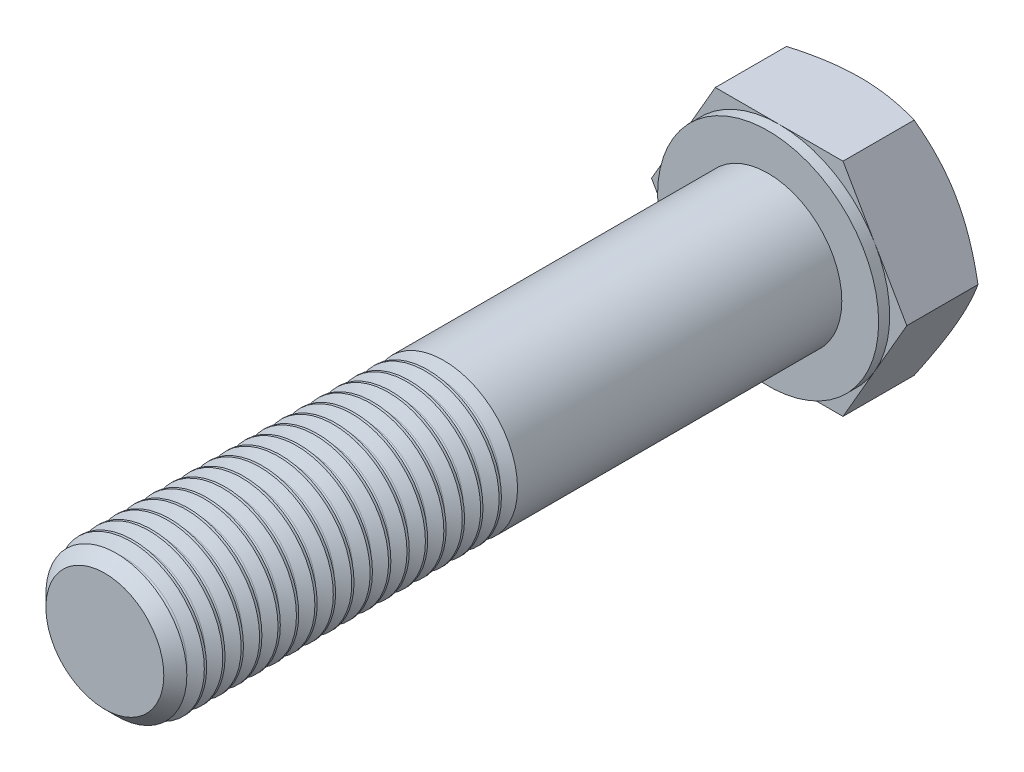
ISO-10303-21;
HEADER;
FILE_DESCRIPTION(('STEP AP214'),'2;1');
FILE_NAME('part.step','',(''),(''),'','','');
FILE_SCHEMA(('AUTOMOTIVE_DESIGN { 1 0 10303 214 1 1 1 1 }'));
ENDSEC;
DATA;
#1=APPLICATION_CONTEXT('core data for automotive mechanical design processes');
#2=APPLICATION_PROTOCOL_DEFINITION('international standard','automotive_design',2000,#1);
#3=PRODUCT_CONTEXT('',#1,'mechanical');
#4=PRODUCT('Part','Part','',(#3));
#5=PRODUCT_RELATED_PRODUCT_CATEGORY('part','',(#4));
#6=PRODUCT_DEFINITION_FORMATION('','',#4);
#7=PRODUCT_DEFINITION_CONTEXT('part definition',#1,'design');
#8=PRODUCT_DEFINITION('design','',#6,#7);
#9=PRODUCT_DEFINITION_SHAPE('','',#8);
#10=(LENGTH_UNIT() NAMED_UNIT(*) SI_UNIT(.MILLI.,.METRE.));
#11=(NAMED_UNIT(*) PLANE_ANGLE_UNIT() SI_UNIT($,.RADIAN.));
#12=(NAMED_UNIT(*) SI_UNIT($,.STERADIAN.) SOLID_ANGLE_UNIT());
#13=UNCERTAINTY_MEASURE_WITH_UNIT(LENGTH_MEASURE(1.E-05),#10,'distance_accuracy_value','');
#14=(GEOMETRIC_REPRESENTATION_CONTEXT(3) GLOBAL_UNCERTAINTY_ASSIGNED_CONTEXT((#13)) GLOBAL_UNIT_ASSIGNED_CONTEXT((#10,
#11,#12)) REPRESENTATION_CONTEXT('',''));
#15=CARTESIAN_POINT('',(0.,0.,0.));
#16=DIRECTION('',(0.,0.,1.));
#17=DIRECTION('',(1.,0.,0.));
#18=AXIS2_PLACEMENT_3D('',#15,#16,#17);
#19=CARTESIAN_POINT('',(0.,-15.,-91.5));
#20=DIRECTION('',(0.,0.,1.));
#21=DIRECTION('',(1.,0.,0.));
#22=AXIS2_PLACEMENT_3D('',#19,#20,#21);
#23=PLANE('',#22);
#24=DIRECTION('',(-0.5,-0.866025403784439,0.));
#25=VECTOR('',#24,1.);
#26=CARTESIAN_POINT('',(-19.4855715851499,-3.74999999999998,-91.5));
#27=LINE('',#26,#25);
#28=CARTESIAN_POINT('',(-12.9903810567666,7.50000000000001,-91.5));
#29=VERTEX_POINT('',#28);
#30=CARTESIAN_POINT('',(-17.3205080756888,0.,-91.5));
#31=VERTEX_POINT('',#30);
#32=EDGE_CURVE('E511',#29,#31,#27,.T.);
#33=ORIENTED_EDGE('',*,*,#32,.T.);
#34=DIRECTION('',(0.5,-0.866025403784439,0.));
#35=VECTOR('',#34,1.);
#36=CARTESIAN_POINT('',(-6.49519052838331,-18.75,-91.5));
#37=LINE('',#36,#35);
#38=CARTESIAN_POINT('',(-12.9903810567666,-7.5,-91.5));
#39=VERTEX_POINT('',#38);
#40=EDGE_CURVE('E516',#31,#39,#37,.T.);
#41=ORIENTED_EDGE('',*,*,#40,.T.);
#42=CARTESIAN_POINT('',(0.,0.,-91.5));
#43=DIRECTION('',(0.,0.,-1.));
#44=DIRECTION('',(-1.,0.,0.));
#45=AXIS2_PLACEMENT_3D('',#42,#43,#44);
#46=CIRCLE('',#45,15.);
#47=EDGE_CURVE('E231',#39,#29,#46,.T.);
#48=ORIENTED_EDGE('',*,*,#47,.T.);
#49=EDGE_LOOP('',(#33,#41,#48));
#50=FACE_BOUND('',#49,.T.);
#51=ADVANCED_FACE('F34',(#50),#23,.T.);
#52=CARTESIAN_POINT('',(0.,-15.,-91.5));
#53=VERTEX_POINT('',#52);
#54=EDGE_CURVE('E497',#53,#39,#46,.T.);
#55=ORIENTED_EDGE('',*,*,#54,.T.);
#56=CARTESIAN_POINT('',(-8.66025403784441,-15.,-91.5));
#57=VERTEX_POINT('',#56);
#58=EDGE_CURVE('E520',#39,#57,#37,.T.);
#59=ORIENTED_EDGE('',*,*,#58,.T.);
#60=DIRECTION('',(1.,0.,0.));
#61=VECTOR('',#60,1.);
#62=CARTESIAN_POINT('',(0.,-15.,-91.5));
#63=LINE('',#62,#61);
#64=EDGE_CURVE('E206',#57,#53,#63,.T.);
#65=ORIENTED_EDGE('',*,*,#64,.T.);
#66=EDGE_LOOP('',(#55,#59,#65));
#67=FACE_BOUND('',#66,.T.);
#68=ADVANCED_FACE('F519',(#67),#23,.T.);
#69=CARTESIAN_POINT('',(12.9903810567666,-7.49999999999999,-91.5));
#70=VERTEX_POINT('',#69);
#71=EDGE_CURVE('E205',#70,#53,#46,.T.);
#72=ORIENTED_EDGE('',*,*,#71,.T.);
#73=CARTESIAN_POINT('',(8.66025403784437,-15.,-91.5));
#74=VERTEX_POINT('',#73);
#75=EDGE_CURVE('E193',#53,#74,#63,.T.);
#76=ORIENTED_EDGE('',*,*,#75,.T.);
#77=DIRECTION('',(0.5,0.866025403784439,0.));
#78=VECTOR('',#77,1.);
#79=CARTESIAN_POINT('',(6.49519052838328,-18.75,-91.5));
#80=LINE('',#79,#78);
#81=EDGE_CURVE('E203',#74,#70,#80,.T.);
#82=ORIENTED_EDGE('',*,*,#81,.T.);
#83=EDGE_LOOP('',(#72,#76,#82));
#84=FACE_BOUND('',#83,.T.);
#85=ADVANCED_FACE('F202',(#84),#23,.T.);
#86=DIRECTION('',(-1.,0.,0.));
#87=VECTOR('',#86,1.);
#88=CARTESIAN_POINT('',(0.,15.,-91.5));
#89=LINE('',#88,#87);
#90=CARTESIAN_POINT('',(0.,15.,-91.5));
#91=VERTEX_POINT('',#90);
#92=CARTESIAN_POINT('',(-8.6602540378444,15.,-91.5));
#93=VERTEX_POINT('',#92);
#94=EDGE_CURVE('E147',#91,#93,#89,.T.);
#95=ORIENTED_EDGE('',*,*,#94,.T.);
#96=EDGE_CURVE('E506',#93,#29,#27,.T.);
#97=ORIENTED_EDGE('',*,*,#96,.T.);
#98=EDGE_CURVE('E232',#29,#91,#46,.T.);
#99=ORIENTED_EDGE('',*,*,#98,.T.);
#100=EDGE_LOOP('',(#95,#97,#99));
#101=FACE_BOUND('',#100,.T.);
#102=ADVANCED_FACE('F505',(#101),#23,.T.);
#103=CARTESIAN_POINT('',(12.9903810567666,7.5,-91.5));
#104=VERTEX_POINT('',#103);
#105=EDGE_CURVE('E493',#104,#70,#46,.T.);
#106=ORIENTED_EDGE('',*,*,#105,.T.);
#107=CARTESIAN_POINT('',(17.3205080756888,0.,-91.5));
#108=VERTEX_POINT('',#107);
#109=EDGE_CURVE('E222',#70,#108,#80,.T.);
#110=ORIENTED_EDGE('',*,*,#109,.T.);
#111=DIRECTION('',(-0.5,0.866025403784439,0.));
#112=VECTOR('',#111,1.);
#113=CARTESIAN_POINT('',(19.4855715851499,-3.75,-91.5));
#114=LINE('',#113,#112);
#115=EDGE_CURVE('E145',#108,#104,#114,.T.);
#116=ORIENTED_EDGE('',*,*,#115,.T.);
#117=EDGE_LOOP('',(#106,#110,#116));
#118=FACE_BOUND('',#117,.T.);
#119=ADVANCED_FACE('F499',(#118),#23,.T.);
#120=CARTESIAN_POINT('',(8.66025403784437,15.,-91.5));
#121=VERTEX_POINT('',#120);
#122=EDGE_CURVE('E129',#104,#121,#114,.T.);
#123=ORIENTED_EDGE('',*,*,#122,.T.);
#124=EDGE_CURVE('E136',#121,#91,#89,.T.);
#125=ORIENTED_EDGE('',*,*,#124,.T.);
#126=EDGE_CURVE('E236',#91,#104,#46,.T.);
#127=ORIENTED_EDGE('',*,*,#126,.T.);
#128=EDGE_LOOP('',(#123,#125,#127));
#129=FACE_BOUND('',#128,.T.);
#130=ADVANCED_FACE('F481',(#129),#23,.T.);
#131=CARTESIAN_POINT('',(0.,0.,-90.));
#132=DIRECTION('',(0.,0.,-1.));
#133=DIRECTION('',(-1.,0.,0.));
#134=AXIS2_PLACEMENT_3D('',#131,#132,#133);
#135=PLANE('',#134);
#136=CARTESIAN_POINT('',(0.,0.,-90.));
#137=DIRECTION('',(0.,0.,-1.));
#138=DIRECTION('',(-1.,0.,0.));
#139=AXIS2_PLACEMENT_3D('',#136,#137,#138);
#140=CIRCLE('',#139,10.);
#141=CARTESIAN_POINT('',(-10.,0.,-90.));
#142=VERTEX_POINT('',#141);
#143=EDGE_CURVE('E235',#142,#142,#140,.T.);
#144=ORIENTED_EDGE('',*,*,#143,.T.);
#145=EDGE_LOOP('',(#144));
#146=FACE_BOUND('',#145,.T.);
#147=CARTESIAN_POINT('',(0.,0.,-90.));
#148=DIRECTION('',(0.,0.,-1.));
#149=DIRECTION('',(-1.,0.,0.));
#150=AXIS2_PLACEMENT_3D('',#147,#148,#149);
#151=CIRCLE('',#150,15.);
#152=CARTESIAN_POINT('',(-15.,0.,-90.));
#153=VERTEX_POINT('',#152);
#154=EDGE_CURVE('E227',#153,#153,#151,.T.);
#155=ORIENTED_EDGE('',*,*,#154,.F.);
#156=EDGE_LOOP('',(#155));
#157=FACE_BOUND('',#156,.T.);
#158=ADVANCED_FACE('F478',(#146,#157),#135,.F.);
#159=CARTESIAN_POINT('',(0.,0.,0.));
#160=DIRECTION('',(0.,0.,1.));
#161=DIRECTION('',(1.,0.,0.));
#162=AXIS2_PLACEMENT_3D('',#159,#160,#161);
#163=CYLINDRICAL_SURFACE('',#162,10.);
#164=CARTESIAN_POINT('',(0.,0.,-43.5));
#165=DIRECTION('',(0.,0.,1.));
#166=DIRECTION('',(1.,0.,0.));
#167=AXIS2_PLACEMENT_3D('',#164,#165,#166);
#168=CIRCLE('',#167,10.);
#169=CARTESIAN_POINT('',(10.,0.,-43.5));
#170=VERTEX_POINT('',#169);
#171=EDGE_CURVE('E434',#170,#170,#168,.T.);
#172=ORIENTED_EDGE('',*,*,#171,.F.);
#173=EDGE_LOOP('',(#172));
#174=FACE_BOUND('',#173,.T.);
#175=CARTESIAN_POINT('',(0.,0.,-43.8125));
#176=DIRECTION('',(0.,0.,1.));
#177=DIRECTION('',(1.,0.,0.));
#178=AXIS2_PLACEMENT_3D('',#175,#176,#177);
#179=CIRCLE('',#178,10.);
#180=CARTESIAN_POINT('',(10.,0.,-43.8125));
#181=VERTEX_POINT('',#180);
#182=EDGE_CURVE('E43',#181,#181,#179,.T.);
#183=ORIENTED_EDGE('',*,*,#182,.T.);
#184=EDGE_LOOP('',(#183));
#185=FACE_BOUND('',#184,.T.);
#186=ADVANCED_FACE('F452',(#174,#185),#163,.T.);
#187=CARTESIAN_POINT('',(0.,0.,-44.671875));
#188=DIRECTION('',(0.,0.,1.));
#189=DIRECTION('',(1.,0.,0.));
#190=AXIS2_PLACEMENT_3D('',#187,#188,#189);
#191=CONICAL_SURFACE('',#190,8.51151883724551,1.04719755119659);
#192=ORIENTED_EDGE('',*,*,#182,.F.);
#193=EDGE_LOOP('',(#192));
#194=FACE_BOUND('',#193,.T.);
#195=CARTESIAN_POINT('',(0.,0.,-44.671875));
#196=DIRECTION('',(0.,0.,1.));
#197=DIRECTION('',(1.,0.,0.));
#198=AXIS2_PLACEMENT_3D('',#195,#196,#197);
#199=CIRCLE('',#198,8.51151883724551);
#200=CARTESIAN_POINT('',(8.51151883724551,0.,-44.671875));
#201=VERTEX_POINT('',#200);
#202=EDGE_CURVE('E440',#201,#201,#199,.T.);
#203=ORIENTED_EDGE('',*,*,#202,.T.);
#204=EDGE_LOOP('',(#203));
#205=FACE_BOUND('',#204,.T.);
#206=ADVANCED_FACE('F454',(#194,#205),#191,.T.);
#207=CARTESIAN_POINT('',(0.,0.,-46.));
#208=DIRECTION('',(0.,0.,-1.));
#209=DIRECTION('',(-1.,0.,0.));
#210=AXIS2_PLACEMENT_3D('',#207,#208,#209);
#211=CONICAL_SURFACE('',#210,10.,1.04719755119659);
#212=CARTESIAN_POINT('',(0.,0.,-45.140625));
#213=DIRECTION('',(0.,0.,1.));
#214=DIRECTION('',(1.,0.,0.));
#215=AXIS2_PLACEMENT_3D('',#212,#213,#214);
#216=CIRCLE('',#215,8.51151883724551);
#217=CARTESIAN_POINT('',(8.51151883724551,0.,-45.140625));
#218=VERTEX_POINT('',#217);
#219=EDGE_CURVE('E443',#218,#218,#216,.T.);
#220=ORIENTED_EDGE('',*,*,#219,.F.);
#221=EDGE_LOOP('',(#220));
#222=FACE_BOUND('',#221,.T.);
#223=CARTESIAN_POINT('',(0.,0.,-46.));
#224=DIRECTION('',(0.,0.,1.));
#225=DIRECTION('',(1.,0.,0.));
#226=AXIS2_PLACEMENT_3D('',#223,#224,#225);
#227=CIRCLE('',#226,10.);
#228=CARTESIAN_POINT('',(10.,0.,-46.));
#229=VERTEX_POINT('',#228);
#230=EDGE_CURVE('E446',#229,#229,#227,.T.);
#231=ORIENTED_EDGE('',*,*,#230,.T.);
#232=EDGE_LOOP('',(#231));
#233=FACE_BOUND('',#232,.T.);
#234=ADVANCED_FACE('F457',(#222,#233),#211,.T.);
#235=CARTESIAN_POINT('',(0.,0.,-44.90625));
#236=DIRECTION('',(0.,0.,1.));
#237=DIRECTION('',(1.,0.,0.));
#238=AXIS2_PLACEMENT_3D('',#235,#236,#237);
#239=TOROIDAL_SURFACE('',#238,8.64683530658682,0.270632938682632);
#240=ORIENTED_EDGE('',*,*,#202,.F.);
#241=EDGE_LOOP('',(#240));
#242=FACE_BOUND('',#241,.T.);
#243=ORIENTED_EDGE('',*,*,#219,.T.);
#244=EDGE_LOOP('',(#243));
#245=FACE_BOUND('',#244,.T.);
#246=ADVANCED_FACE('F461',(#242,#245),#239,.F.);
#247=ORIENTED_EDGE('',*,*,#230,.F.);
#248=EDGE_LOOP('',(#247));
#249=FACE_BOUND('',#248,.T.);
#250=ORIENTED_EDGE('',*,*,#143,.F.);
#251=EDGE_LOOP('',(#250));
#252=FACE_BOUND('',#251,.T.);
#253=ADVANCED_FACE('F36',(#249,#252),#163,.T.);
#254=CARTESIAN_POINT('',(0.,0.,-42.171875));
#255=DIRECTION('',(0.,0.,1.));
#256=DIRECTION('',(1.,0.,0.));
#257=AXIS2_PLACEMENT_3D('',#254,#255,#256);
#258=CONICAL_SURFACE('',#257,8.51151883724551,1.04719755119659);
#259=CARTESIAN_POINT('',(0.,0.,-41.3125));
#260=DIRECTION('',(0.,0.,1.));
#261=DIRECTION('',(1.,0.,0.));
#262=AXIS2_PLACEMENT_3D('',#259,#260,#261);
#263=CIRCLE('',#262,10.);
#264=CARTESIAN_POINT('',(10.,0.,-41.3125));
#265=VERTEX_POINT('',#264);
#266=EDGE_CURVE('E437',#265,#265,#263,.T.);
#267=ORIENTED_EDGE('',*,*,#266,.F.);
#268=EDGE_LOOP('',(#267));
#269=FACE_BOUND('',#268,.T.);
#270=CARTESIAN_POINT('',(0.,0.,-42.171875));
#271=DIRECTION('',(0.,0.,1.));
#272=DIRECTION('',(1.,0.,0.));
#273=AXIS2_PLACEMENT_3D('',#270,#271,#272);
#274=CIRCLE('',#273,8.51151883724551);
#275=CARTESIAN_POINT('',(8.51151883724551,0.,-42.171875));
#276=VERTEX_POINT('',#275);
#277=EDGE_CURVE('E428',#276,#276,#274,.T.);
#278=ORIENTED_EDGE('',*,*,#277,.T.);
#279=EDGE_LOOP('',(#278));
#280=FACE_BOUND('',#279,.T.);
#281=ADVANCED_FACE('F474',(#269,#280),#258,.T.);
#282=CARTESIAN_POINT('',(0.,0.,-43.5));
#283=DIRECTION('',(0.,0.,-1.));
#284=DIRECTION('',(-1.,0.,0.));
#285=AXIS2_PLACEMENT_3D('',#282,#283,#284);
#286=CONICAL_SURFACE('',#285,10.,1.04719755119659);
#287=CARTESIAN_POINT('',(0.,0.,-42.640625));
#288=DIRECTION('',(0.,0.,1.));
#289=DIRECTION('',(1.,0.,0.));
#290=AXIS2_PLACEMENT_3D('',#287,#288,#289);
#291=CIRCLE('',#290,8.51151883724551);
#292=CARTESIAN_POINT('',(8.51151883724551,0.,-42.640625));
#293=VERTEX_POINT('',#292);
#294=EDGE_CURVE('E431',#293,#293,#291,.T.);
#295=ORIENTED_EDGE('',*,*,#294,.F.);
#296=EDGE_LOOP('',(#295));
#297=FACE_BOUND('',#296,.T.);
#298=ORIENTED_EDGE('',*,*,#171,.T.);
#299=EDGE_LOOP('',(#298));
#300=FACE_BOUND('',#299,.T.);
#301=ADVANCED_FACE('F1217',(#297,#300),#286,.T.);
#302=CARTESIAN_POINT('',(0.,0.,-42.40625));
#303=DIRECTION('',(0.,0.,1.));
#304=DIRECTION('',(1.,0.,0.));
#305=AXIS2_PLACEMENT_3D('',#302,#303,#304);
#306=TOROIDAL_SURFACE('',#305,8.64683530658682,0.270632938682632);
#307=ORIENTED_EDGE('',*,*,#277,.F.);
#308=EDGE_LOOP('',(#307));
#309=FACE_BOUND('',#308,.T.);
#310=ORIENTED_EDGE('',*,*,#294,.T.);
#311=EDGE_LOOP('',(#310));
#312=FACE_BOUND('',#311,.T.);
#313=ADVANCED_FACE('F1208',(#309,#312),#306,.F.);
#314=CARTESIAN_POINT('',(0.,0.,-41.));
#315=DIRECTION('',(0.,0.,1.));
#316=DIRECTION('',(1.,0.,0.));
#317=AXIS2_PLACEMENT_3D('',#314,#315,#316);
#318=CIRCLE('',#317,10.);
#319=CARTESIAN_POINT('',(10.,0.,-41.));
#320=VERTEX_POINT('',#319);
#321=EDGE_CURVE('E422',#320,#320,#318,.T.);
#322=ORIENTED_EDGE('',*,*,#321,.F.);
#323=EDGE_LOOP('',(#322));
#324=FACE_BOUND('',#323,.T.);
#325=ORIENTED_EDGE('',*,*,#266,.T.);
#326=EDGE_LOOP('',(#325));
#327=FACE_BOUND('',#326,.T.);
#328=ADVANCED_FACE('F1171',(#324,#327),#163,.T.);
#329=CARTESIAN_POINT('',(0.,0.,-39.671875));
#330=DIRECTION('',(0.,0.,1.));
#331=DIRECTION('',(1.,0.,0.));
#332=AXIS2_PLACEMENT_3D('',#329,#330,#331);
#333=CONICAL_SURFACE('',#332,8.51151883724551,1.04719755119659);
#334=CARTESIAN_POINT('',(0.,0.,-38.8125));
#335=DIRECTION('',(0.,0.,1.));
#336=DIRECTION('',(1.,0.,0.));
#337=AXIS2_PLACEMENT_3D('',#334,#335,#336);
#338=CIRCLE('',#337,10.);
#339=CARTESIAN_POINT('',(10.,0.,-38.8125));
#340=VERTEX_POINT('',#339);
#341=EDGE_CURVE('E425',#340,#340,#338,.T.);
#342=ORIENTED_EDGE('',*,*,#341,.F.);
#343=EDGE_LOOP('',(#342));
#344=FACE_BOUND('',#343,.T.);
#345=CARTESIAN_POINT('',(0.,0.,-39.671875));
#346=DIRECTION('',(0.,0.,1.));
#347=DIRECTION('',(1.,0.,0.));
#348=AXIS2_PLACEMENT_3D('',#345,#346,#347);
#349=CIRCLE('',#348,8.51151883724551);
#350=CARTESIAN_POINT('',(8.51151883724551,0.,-39.671875));
#351=VERTEX_POINT('',#350);
#352=EDGE_CURVE('E416',#351,#351,#349,.T.);
#353=ORIENTED_EDGE('',*,*,#352,.T.);
#354=EDGE_LOOP('',(#353));
#355=FACE_BOUND('',#354,.T.);
#356=ADVANCED_FACE('F1189',(#344,#355),#333,.T.);
#357=CARTESIAN_POINT('',(0.,0.,-41.));
#358=DIRECTION('',(0.,0.,-1.));
#359=DIRECTION('',(-1.,0.,0.));
#360=AXIS2_PLACEMENT_3D('',#357,#358,#359);
#361=CONICAL_SURFACE('',#360,10.,1.04719755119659);
#362=CARTESIAN_POINT('',(0.,0.,-40.140625));
#363=DIRECTION('',(0.,0.,1.));
#364=DIRECTION('',(1.,0.,0.));
#365=AXIS2_PLACEMENT_3D('',#362,#363,#364);
#366=CIRCLE('',#365,8.51151883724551);
#367=CARTESIAN_POINT('',(8.51151883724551,0.,-40.140625));
#368=VERTEX_POINT('',#367);
#369=EDGE_CURVE('E419',#368,#368,#366,.T.);
#370=ORIENTED_EDGE('',*,*,#369,.F.);
#371=EDGE_LOOP('',(#370));
#372=FACE_BOUND('',#371,.T.);
#373=ORIENTED_EDGE('',*,*,#321,.T.);
#374=EDGE_LOOP('',(#373));
#375=FACE_BOUND('',#374,.T.);
#376=ADVANCED_FACE('F1179',(#372,#375),#361,.T.);
#377=CARTESIAN_POINT('',(0.,0.,-39.90625));
#378=DIRECTION('',(0.,0.,1.));
#379=DIRECTION('',(1.,0.,0.));
#380=AXIS2_PLACEMENT_3D('',#377,#378,#379);
#381=TOROIDAL_SURFACE('',#380,8.64683530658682,0.270632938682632);
#382=ORIENTED_EDGE('',*,*,#352,.F.);
#383=EDGE_LOOP('',(#382));
#384=FACE_BOUND('',#383,.T.);
#385=ORIENTED_EDGE('',*,*,#369,.T.);
#386=EDGE_LOOP('',(#385));
#387=FACE_BOUND('',#386,.T.);
#388=ADVANCED_FACE('F1169',(#384,#387),#381,.F.);
#389=CARTESIAN_POINT('',(0.,0.,-38.5));
#390=DIRECTION('',(0.,0.,1.));
#391=DIRECTION('',(1.,0.,0.));
#392=AXIS2_PLACEMENT_3D('',#389,#390,#391);
#393=CIRCLE('',#392,10.);
#394=CARTESIAN_POINT('',(10.,0.,-38.5));
#395=VERTEX_POINT('',#394);
#396=EDGE_CURVE('E410',#395,#395,#393,.T.);
#397=ORIENTED_EDGE('',*,*,#396,.F.);
#398=EDGE_LOOP('',(#397));
#399=FACE_BOUND('',#398,.T.);
#400=ORIENTED_EDGE('',*,*,#341,.T.);
#401=EDGE_LOOP('',(#400));
#402=FACE_BOUND('',#401,.T.);
#403=ADVANCED_FACE('F1132',(#399,#402),#163,.T.);
#404=CARTESIAN_POINT('',(0.,0.,-37.171875));
#405=DIRECTION('',(0.,0.,1.));
#406=DIRECTION('',(1.,0.,0.));
#407=AXIS2_PLACEMENT_3D('',#404,#405,#406);
#408=CONICAL_SURFACE('',#407,8.51151883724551,1.04719755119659);
#409=CARTESIAN_POINT('',(0.,0.,-36.3125));
#410=DIRECTION('',(0.,0.,1.));
#411=DIRECTION('',(1.,0.,0.));
#412=AXIS2_PLACEMENT_3D('',#409,#410,#411);
#413=CIRCLE('',#412,10.);
#414=CARTESIAN_POINT('',(10.,0.,-36.3125));
#415=VERTEX_POINT('',#414);
#416=EDGE_CURVE('E413',#415,#415,#413,.T.);
#417=ORIENTED_EDGE('',*,*,#416,.F.);
#418=EDGE_LOOP('',(#417));
#419=FACE_BOUND('',#418,.T.);
#420=CARTESIAN_POINT('',(0.,0.,-37.171875));
#421=DIRECTION('',(0.,0.,1.));
#422=DIRECTION('',(1.,0.,0.));
#423=AXIS2_PLACEMENT_3D('',#420,#421,#422);
#424=CIRCLE('',#423,8.51151883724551);
#425=CARTESIAN_POINT('',(8.51151883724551,0.,-37.171875));
#426=VERTEX_POINT('',#425);
#427=EDGE_CURVE('E404',#426,#426,#424,.T.);
#428=ORIENTED_EDGE('',*,*,#427,.T.);
#429=EDGE_LOOP('',(#428));
#430=FACE_BOUND('',#429,.T.);
#431=ADVANCED_FACE('F1150',(#419,#430),#408,.T.);
#432=CARTESIAN_POINT('',(0.,0.,-38.5));
#433=DIRECTION('',(0.,0.,-1.));
#434=DIRECTION('',(-1.,0.,0.));
#435=AXIS2_PLACEMENT_3D('',#432,#433,#434);
#436=CONICAL_SURFACE('',#435,10.,1.04719755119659);
#437=CARTESIAN_POINT('',(0.,0.,-37.640625));
#438=DIRECTION('',(0.,0.,1.));
#439=DIRECTION('',(1.,0.,0.));
#440=AXIS2_PLACEMENT_3D('',#437,#438,#439);
#441=CIRCLE('',#440,8.51151883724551);
#442=CARTESIAN_POINT('',(8.51151883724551,0.,-37.640625));
#443=VERTEX_POINT('',#442);
#444=EDGE_CURVE('E407',#443,#443,#441,.T.);
#445=ORIENTED_EDGE('',*,*,#444,.F.);
#446=EDGE_LOOP('',(#445));
#447=FACE_BOUND('',#446,.T.);
#448=ORIENTED_EDGE('',*,*,#396,.T.);
#449=EDGE_LOOP('',(#448));
#450=FACE_BOUND('',#449,.T.);
#451=ADVANCED_FACE('F1140',(#447,#450),#436,.T.);
#452=CARTESIAN_POINT('',(0.,0.,-37.40625));
#453=DIRECTION('',(0.,0.,1.));
#454=DIRECTION('',(1.,0.,0.));
#455=AXIS2_PLACEMENT_3D('',#452,#453,#454);
#456=TOROIDAL_SURFACE('',#455,8.64683530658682,0.270632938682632);
#457=ORIENTED_EDGE('',*,*,#427,.F.);
#458=EDGE_LOOP('',(#457));
#459=FACE_BOUND('',#458,.T.);
#460=ORIENTED_EDGE('',*,*,#444,.T.);
#461=EDGE_LOOP('',(#460));
#462=FACE_BOUND('',#461,.T.);
#463=ADVANCED_FACE('F1130',(#459,#462),#456,.F.);
#464=CARTESIAN_POINT('',(0.,0.,-36.));
#465=DIRECTION('',(0.,0.,1.));
#466=DIRECTION('',(1.,0.,0.));
#467=AXIS2_PLACEMENT_3D('',#464,#465,#466);
#468=CIRCLE('',#467,10.);
#469=CARTESIAN_POINT('',(10.,0.,-36.));
#470=VERTEX_POINT('',#469);
#471=EDGE_CURVE('E398',#470,#470,#468,.T.);
#472=ORIENTED_EDGE('',*,*,#471,.F.);
#473=EDGE_LOOP('',(#472));
#474=FACE_BOUND('',#473,.T.);
#475=ORIENTED_EDGE('',*,*,#416,.T.);
#476=EDGE_LOOP('',(#475));
#477=FACE_BOUND('',#476,.T.);
#478=ADVANCED_FACE('F1093',(#474,#477),#163,.T.);
#479=CARTESIAN_POINT('',(0.,0.,-34.671875));
#480=DIRECTION('',(0.,0.,1.));
#481=DIRECTION('',(1.,0.,0.));
#482=AXIS2_PLACEMENT_3D('',#479,#480,#481);
#483=CONICAL_SURFACE('',#482,8.51151883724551,1.04719755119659);
#484=CARTESIAN_POINT('',(0.,0.,-33.8125));
#485=DIRECTION('',(0.,0.,1.));
#486=DIRECTION('',(1.,0.,0.));
#487=AXIS2_PLACEMENT_3D('',#484,#485,#486);
#488=CIRCLE('',#487,10.);
#489=CARTESIAN_POINT('',(10.,0.,-33.8125));
#490=VERTEX_POINT('',#489);
#491=EDGE_CURVE('E401',#490,#490,#488,.T.);
#492=ORIENTED_EDGE('',*,*,#491,.F.);
#493=EDGE_LOOP('',(#492));
#494=FACE_BOUND('',#493,.T.);
#495=CARTESIAN_POINT('',(0.,0.,-34.671875));
#496=DIRECTION('',(0.,0.,1.));
#497=DIRECTION('',(1.,0.,0.));
#498=AXIS2_PLACEMENT_3D('',#495,#496,#497);
#499=CIRCLE('',#498,8.51151883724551);
#500=CARTESIAN_POINT('',(8.51151883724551,0.,-34.671875));
#501=VERTEX_POINT('',#500);
#502=EDGE_CURVE('E392',#501,#501,#499,.T.);
#503=ORIENTED_EDGE('',*,*,#502,.T.);
#504=EDGE_LOOP('',(#503));
#505=FACE_BOUND('',#504,.T.);
#506=ADVANCED_FACE('F1111',(#494,#505),#483,.T.);
#507=CARTESIAN_POINT('',(0.,0.,-36.));
#508=DIRECTION('',(0.,0.,-1.));
#509=DIRECTION('',(-1.,0.,0.));
#510=AXIS2_PLACEMENT_3D('',#507,#508,#509);
#511=CONICAL_SURFACE('',#510,10.,1.04719755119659);
#512=CARTESIAN_POINT('',(0.,0.,-35.140625));
#513=DIRECTION('',(0.,0.,1.));
#514=DIRECTION('',(1.,0.,0.));
#515=AXIS2_PLACEMENT_3D('',#512,#513,#514);
#516=CIRCLE('',#515,8.51151883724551);
#517=CARTESIAN_POINT('',(8.51151883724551,0.,-35.140625));
#518=VERTEX_POINT('',#517);
#519=EDGE_CURVE('E395',#518,#518,#516,.T.);
#520=ORIENTED_EDGE('',*,*,#519,.F.);
#521=EDGE_LOOP('',(#520));
#522=FACE_BOUND('',#521,.T.);
#523=ORIENTED_EDGE('',*,*,#471,.T.);
#524=EDGE_LOOP('',(#523));
#525=FACE_BOUND('',#524,.T.);
#526=ADVANCED_FACE('F1101',(#522,#525),#511,.T.);
#527=CARTESIAN_POINT('',(0.,0.,-34.90625));
#528=DIRECTION('',(0.,0.,1.));
#529=DIRECTION('',(1.,0.,0.));
#530=AXIS2_PLACEMENT_3D('',#527,#528,#529);
#531=TOROIDAL_SURFACE('',#530,8.64683530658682,0.270632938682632);
#532=ORIENTED_EDGE('',*,*,#502,.F.);
#533=EDGE_LOOP('',(#532));
#534=FACE_BOUND('',#533,.T.);
#535=ORIENTED_EDGE('',*,*,#519,.T.);
#536=EDGE_LOOP('',(#535));
#537=FACE_BOUND('',#536,.T.);
#538=ADVANCED_FACE('F1091',(#534,#537),#531,.F.);
#539=CARTESIAN_POINT('',(0.,0.,-33.5));
#540=DIRECTION('',(0.,0.,1.));
#541=DIRECTION('',(1.,0.,0.));
#542=AXIS2_PLACEMENT_3D('',#539,#540,#541);
#543=CIRCLE('',#542,10.);
#544=CARTESIAN_POINT('',(10.,0.,-33.5));
#545=VERTEX_POINT('',#544);
#546=EDGE_CURVE('E386',#545,#545,#543,.T.);
#547=ORIENTED_EDGE('',*,*,#546,.F.);
#548=EDGE_LOOP('',(#547));
#549=FACE_BOUND('',#548,.T.);
#550=ORIENTED_EDGE('',*,*,#491,.T.);
#551=EDGE_LOOP('',(#550));
#552=FACE_BOUND('',#551,.T.);
#553=ADVANCED_FACE('F1054',(#549,#552),#163,.T.);
#554=CARTESIAN_POINT('',(0.,0.,-32.171875));
#555=DIRECTION('',(0.,0.,1.));
#556=DIRECTION('',(1.,0.,0.));
#557=AXIS2_PLACEMENT_3D('',#554,#555,#556);
#558=CONICAL_SURFACE('',#557,8.51151883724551,1.04719755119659);
#559=CARTESIAN_POINT('',(0.,0.,-31.3125));
#560=DIRECTION('',(0.,0.,1.));
#561=DIRECTION('',(1.,0.,0.));
#562=AXIS2_PLACEMENT_3D('',#559,#560,#561);
#563=CIRCLE('',#562,10.);
#564=CARTESIAN_POINT('',(10.,0.,-31.3125));
#565=VERTEX_POINT('',#564);
#566=EDGE_CURVE('E389',#565,#565,#563,.T.);
#567=ORIENTED_EDGE('',*,*,#566,.F.);
#568=EDGE_LOOP('',(#567));
#569=FACE_BOUND('',#568,.T.);
#570=CARTESIAN_POINT('',(0.,0.,-32.171875));
#571=DIRECTION('',(0.,0.,1.));
#572=DIRECTION('',(1.,0.,0.));
#573=AXIS2_PLACEMENT_3D('',#570,#571,#572);
#574=CIRCLE('',#573,8.51151883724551);
#575=CARTESIAN_POINT('',(8.51151883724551,0.,-32.171875));
#576=VERTEX_POINT('',#575);
#577=EDGE_CURVE('E380',#576,#576,#574,.T.);
#578=ORIENTED_EDGE('',*,*,#577,.T.);
#579=EDGE_LOOP('',(#578));
#580=FACE_BOUND('',#579,.T.);
#581=ADVANCED_FACE('F1072',(#569,#580),#558,.T.);
#582=CARTESIAN_POINT('',(0.,0.,-33.5));
#583=DIRECTION('',(0.,0.,-1.));
#584=DIRECTION('',(-1.,0.,0.));
#585=AXIS2_PLACEMENT_3D('',#582,#583,#584);
#586=CONICAL_SURFACE('',#585,10.,1.04719755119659);
#587=CARTESIAN_POINT('',(0.,0.,-32.640625));
#588=DIRECTION('',(0.,0.,1.));
#589=DIRECTION('',(1.,0.,0.));
#590=AXIS2_PLACEMENT_3D('',#587,#588,#589);
#591=CIRCLE('',#590,8.51151883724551);
#592=CARTESIAN_POINT('',(8.51151883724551,0.,-32.640625));
#593=VERTEX_POINT('',#592);
#594=EDGE_CURVE('E383',#593,#593,#591,.T.);
#595=ORIENTED_EDGE('',*,*,#594,.F.);
#596=EDGE_LOOP('',(#595));
#597=FACE_BOUND('',#596,.T.);
#598=ORIENTED_EDGE('',*,*,#546,.T.);
#599=EDGE_LOOP('',(#598));
#600=FACE_BOUND('',#599,.T.);
#601=ADVANCED_FACE('F1062',(#597,#600),#586,.T.);
#602=CARTESIAN_POINT('',(0.,0.,-32.40625));
#603=DIRECTION('',(0.,0.,1.));
#604=DIRECTION('',(1.,0.,0.));
#605=AXIS2_PLACEMENT_3D('',#602,#603,#604);
#606=TOROIDAL_SURFACE('',#605,8.64683530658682,0.270632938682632);
#607=ORIENTED_EDGE('',*,*,#577,.F.);
#608=EDGE_LOOP('',(#607));
#609=FACE_BOUND('',#608,.T.);
#610=ORIENTED_EDGE('',*,*,#594,.T.);
#611=EDGE_LOOP('',(#610));
#612=FACE_BOUND('',#611,.T.);
#613=ADVANCED_FACE('F1052',(#609,#612),#606,.F.);
#614=CARTESIAN_POINT('',(0.,0.,-31.));
#615=DIRECTION('',(0.,0.,1.));
#616=DIRECTION('',(1.,0.,0.));
#617=AXIS2_PLACEMENT_3D('',#614,#615,#616);
#618=CIRCLE('',#617,10.);
#619=CARTESIAN_POINT('',(10.,0.,-31.));
#620=VERTEX_POINT('',#619);
#621=EDGE_CURVE('E374',#620,#620,#618,.T.);
#622=ORIENTED_EDGE('',*,*,#621,.F.);
#623=EDGE_LOOP('',(#622));
#624=FACE_BOUND('',#623,.T.);
#625=ORIENTED_EDGE('',*,*,#566,.T.);
#626=EDGE_LOOP('',(#625));
#627=FACE_BOUND('',#626,.T.);
#628=ADVANCED_FACE('F1015',(#624,#627),#163,.T.);
#629=CARTESIAN_POINT('',(0.,0.,-29.671875));
#630=DIRECTION('',(0.,0.,1.));
#631=DIRECTION('',(1.,0.,0.));
#632=AXIS2_PLACEMENT_3D('',#629,#630,#631);
#633=CONICAL_SURFACE('',#632,8.51151883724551,1.04719755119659);
#634=CARTESIAN_POINT('',(0.,0.,-28.8125));
#635=DIRECTION('',(0.,0.,1.));
#636=DIRECTION('',(1.,0.,0.));
#637=AXIS2_PLACEMENT_3D('',#634,#635,#636);
#638=CIRCLE('',#637,10.);
#639=CARTESIAN_POINT('',(10.,0.,-28.8125));
#640=VERTEX_POINT('',#639);
#641=EDGE_CURVE('E377',#640,#640,#638,.T.);
#642=ORIENTED_EDGE('',*,*,#641,.F.);
#643=EDGE_LOOP('',(#642));
#644=FACE_BOUND('',#643,.T.);
#645=CARTESIAN_POINT('',(0.,0.,-29.671875));
#646=DIRECTION('',(0.,0.,1.));
#647=DIRECTION('',(1.,0.,0.));
#648=AXIS2_PLACEMENT_3D('',#645,#646,#647);
#649=CIRCLE('',#648,8.51151883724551);
#650=CARTESIAN_POINT('',(8.51151883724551,0.,-29.671875));
#651=VERTEX_POINT('',#650);
#652=EDGE_CURVE('E368',#651,#651,#649,.T.);
#653=ORIENTED_EDGE('',*,*,#652,.T.);
#654=EDGE_LOOP('',(#653));
#655=FACE_BOUND('',#654,.T.);
#656=ADVANCED_FACE('F1033',(#644,#655),#633,.T.);
#657=CARTESIAN_POINT('',(0.,0.,-31.));
#658=DIRECTION('',(0.,0.,-1.));
#659=DIRECTION('',(-1.,0.,0.));
#660=AXIS2_PLACEMENT_3D('',#657,#658,#659);
#661=CONICAL_SURFACE('',#660,10.,1.04719755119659);
#662=CARTESIAN_POINT('',(0.,0.,-30.140625));
#663=DIRECTION('',(0.,0.,1.));
#664=DIRECTION('',(1.,0.,0.));
#665=AXIS2_PLACEMENT_3D('',#662,#663,#664);
#666=CIRCLE('',#665,8.51151883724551);
#667=CARTESIAN_POINT('',(8.51151883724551,0.,-30.140625));
#668=VERTEX_POINT('',#667);
#669=EDGE_CURVE('E371',#668,#668,#666,.T.);
#670=ORIENTED_EDGE('',*,*,#669,.F.);
#671=EDGE_LOOP('',(#670));
#672=FACE_BOUND('',#671,.T.);
#673=ORIENTED_EDGE('',*,*,#621,.T.);
#674=EDGE_LOOP('',(#673));
#675=FACE_BOUND('',#674,.T.);
#676=ADVANCED_FACE('F1023',(#672,#675),#661,.T.);
#677=CARTESIAN_POINT('',(0.,0.,-29.90625));
#678=DIRECTION('',(0.,0.,1.));
#679=DIRECTION('',(1.,0.,0.));
#680=AXIS2_PLACEMENT_3D('',#677,#678,#679);
#681=TOROIDAL_SURFACE('',#680,8.64683530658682,0.270632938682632);
#682=ORIENTED_EDGE('',*,*,#652,.F.);
#683=EDGE_LOOP('',(#682));
#684=FACE_BOUND('',#683,.T.);
#685=ORIENTED_EDGE('',*,*,#669,.T.);
#686=EDGE_LOOP('',(#685));
#687=FACE_BOUND('',#686,.T.);
#688=ADVANCED_FACE('F1013',(#684,#687),#681,.F.);
#689=CARTESIAN_POINT('',(0.,0.,-28.5));
#690=DIRECTION('',(0.,0.,1.));
#691=DIRECTION('',(1.,0.,0.));
#692=AXIS2_PLACEMENT_3D('',#689,#690,#691);
#693=CIRCLE('',#692,10.);
#694=CARTESIAN_POINT('',(10.,0.,-28.5));
#695=VERTEX_POINT('',#694);
#696=EDGE_CURVE('E362',#695,#695,#693,.T.);
#697=ORIENTED_EDGE('',*,*,#696,.F.);
#698=EDGE_LOOP('',(#697));
#699=FACE_BOUND('',#698,.T.);
#700=ORIENTED_EDGE('',*,*,#641,.T.);
#701=EDGE_LOOP('',(#700));
#702=FACE_BOUND('',#701,.T.);
#703=ADVANCED_FACE('F976',(#699,#702),#163,.T.);
#704=CARTESIAN_POINT('',(0.,0.,-27.171875));
#705=DIRECTION('',(0.,0.,1.));
#706=DIRECTION('',(1.,0.,0.));
#707=AXIS2_PLACEMENT_3D('',#704,#705,#706);
#708=CONICAL_SURFACE('',#707,8.51151883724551,1.04719755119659);
#709=CARTESIAN_POINT('',(0.,0.,-26.3125));
#710=DIRECTION('',(0.,0.,1.));
#711=DIRECTION('',(1.,0.,0.));
#712=AXIS2_PLACEMENT_3D('',#709,#710,#711);
#713=CIRCLE('',#712,10.);
#714=CARTESIAN_POINT('',(10.,0.,-26.3125));
#715=VERTEX_POINT('',#714);
#716=EDGE_CURVE('E365',#715,#715,#713,.T.);
#717=ORIENTED_EDGE('',*,*,#716,.F.);
#718=EDGE_LOOP('',(#717));
#719=FACE_BOUND('',#718,.T.);
#720=CARTESIAN_POINT('',(0.,0.,-27.171875));
#721=DIRECTION('',(0.,0.,1.));
#722=DIRECTION('',(1.,0.,0.));
#723=AXIS2_PLACEMENT_3D('',#720,#721,#722);
#724=CIRCLE('',#723,8.51151883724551);
#725=CARTESIAN_POINT('',(8.51151883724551,0.,-27.171875));
#726=VERTEX_POINT('',#725);
#727=EDGE_CURVE('E356',#726,#726,#724,.T.);
#728=ORIENTED_EDGE('',*,*,#727,.T.);
#729=EDGE_LOOP('',(#728));
#730=FACE_BOUND('',#729,.T.);
#731=ADVANCED_FACE('F994',(#719,#730),#708,.T.);
#732=CARTESIAN_POINT('',(0.,0.,-28.5));
#733=DIRECTION('',(0.,0.,-1.));
#734=DIRECTION('',(-1.,0.,0.));
#735=AXIS2_PLACEMENT_3D('',#732,#733,#734);
#736=CONICAL_SURFACE('',#735,10.,1.04719755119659);
#737=CARTESIAN_POINT('',(0.,0.,-27.640625));
#738=DIRECTION('',(0.,0.,1.));
#739=DIRECTION('',(1.,0.,0.));
#740=AXIS2_PLACEMENT_3D('',#737,#738,#739);
#741=CIRCLE('',#740,8.51151883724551);
#742=CARTESIAN_POINT('',(8.51151883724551,0.,-27.640625));
#743=VERTEX_POINT('',#742);
#744=EDGE_CURVE('E359',#743,#743,#741,.T.);
#745=ORIENTED_EDGE('',*,*,#744,.F.);
#746=EDGE_LOOP('',(#745));
#747=FACE_BOUND('',#746,.T.);
#748=ORIENTED_EDGE('',*,*,#696,.T.);
#749=EDGE_LOOP('',(#748));
#750=FACE_BOUND('',#749,.T.);
#751=ADVANCED_FACE('F984',(#747,#750),#736,.T.);
#752=CARTESIAN_POINT('',(0.,0.,-27.40625));
#753=DIRECTION('',(0.,0.,1.));
#754=DIRECTION('',(1.,0.,0.));
#755=AXIS2_PLACEMENT_3D('',#752,#753,#754);
#756=TOROIDAL_SURFACE('',#755,8.64683530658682,0.270632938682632);
#757=ORIENTED_EDGE('',*,*,#727,.F.);
#758=EDGE_LOOP('',(#757));
#759=FACE_BOUND('',#758,.T.);
#760=ORIENTED_EDGE('',*,*,#744,.T.);
#761=EDGE_LOOP('',(#760));
#762=FACE_BOUND('',#761,.T.);
#763=ADVANCED_FACE('F974',(#759,#762),#756,.F.);
#764=CARTESIAN_POINT('',(0.,0.,-26.));
#765=DIRECTION('',(0.,0.,1.));
#766=DIRECTION('',(1.,0.,0.));
#767=AXIS2_PLACEMENT_3D('',#764,#765,#766);
#768=CIRCLE('',#767,10.);
#769=CARTESIAN_POINT('',(10.,0.,-26.));
#770=VERTEX_POINT('',#769);
#771=EDGE_CURVE('E350',#770,#770,#768,.T.);
#772=ORIENTED_EDGE('',*,*,#771,.F.);
#773=EDGE_LOOP('',(#772));
#774=FACE_BOUND('',#773,.T.);
#775=ORIENTED_EDGE('',*,*,#716,.T.);
#776=EDGE_LOOP('',(#775));
#777=FACE_BOUND('',#776,.T.);
#778=ADVANCED_FACE('F937',(#774,#777),#163,.T.);
#779=CARTESIAN_POINT('',(0.,0.,-24.671875));
#780=DIRECTION('',(0.,0.,1.));
#781=DIRECTION('',(1.,0.,0.));
#782=AXIS2_PLACEMENT_3D('',#779,#780,#781);
#783=CONICAL_SURFACE('',#782,8.51151883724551,1.04719755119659);
#784=CARTESIAN_POINT('',(0.,0.,-23.8125));
#785=DIRECTION('',(0.,0.,1.));
#786=DIRECTION('',(1.,0.,0.));
#787=AXIS2_PLACEMENT_3D('',#784,#785,#786);
#788=CIRCLE('',#787,10.);
#789=CARTESIAN_POINT('',(10.,0.,-23.8125));
#790=VERTEX_POINT('',#789);
#791=EDGE_CURVE('E353',#790,#790,#788,.T.);
#792=ORIENTED_EDGE('',*,*,#791,.F.);
#793=EDGE_LOOP('',(#792));
#794=FACE_BOUND('',#793,.T.);
#795=CARTESIAN_POINT('',(0.,0.,-24.671875));
#796=DIRECTION('',(0.,0.,1.));
#797=DIRECTION('',(1.,0.,0.));
#798=AXIS2_PLACEMENT_3D('',#795,#796,#797);
#799=CIRCLE('',#798,8.51151883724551);
#800=CARTESIAN_POINT('',(8.51151883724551,0.,-24.671875));
#801=VERTEX_POINT('',#800);
#802=EDGE_CURVE('E344',#801,#801,#799,.T.);
#803=ORIENTED_EDGE('',*,*,#802,.T.);
#804=EDGE_LOOP('',(#803));
#805=FACE_BOUND('',#804,.T.);
#806=ADVANCED_FACE('F955',(#794,#805),#783,.T.);
#807=CARTESIAN_POINT('',(0.,0.,-26.));
#808=DIRECTION('',(0.,0.,-1.));
#809=DIRECTION('',(-1.,0.,0.));
#810=AXIS2_PLACEMENT_3D('',#807,#808,#809);
#811=CONICAL_SURFACE('',#810,10.,1.04719755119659);
#812=CARTESIAN_POINT('',(0.,0.,-25.140625));
#813=DIRECTION('',(0.,0.,1.));
#814=DIRECTION('',(1.,0.,0.));
#815=AXIS2_PLACEMENT_3D('',#812,#813,#814);
#816=CIRCLE('',#815,8.51151883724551);
#817=CARTESIAN_POINT('',(8.51151883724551,0.,-25.140625));
#818=VERTEX_POINT('',#817);
#819=EDGE_CURVE('E347',#818,#818,#816,.T.);
#820=ORIENTED_EDGE('',*,*,#819,.F.);
#821=EDGE_LOOP('',(#820));
#822=FACE_BOUND('',#821,.T.);
#823=ORIENTED_EDGE('',*,*,#771,.T.);
#824=EDGE_LOOP('',(#823));
#825=FACE_BOUND('',#824,.T.);
#826=ADVANCED_FACE('F945',(#822,#825),#811,.T.);
#827=CARTESIAN_POINT('',(0.,0.,-24.90625));
#828=DIRECTION('',(0.,0.,1.));
#829=DIRECTION('',(1.,0.,0.));
#830=AXIS2_PLACEMENT_3D('',#827,#828,#829);
#831=TOROIDAL_SURFACE('',#830,8.64683530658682,0.270632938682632);
#832=ORIENTED_EDGE('',*,*,#802,.F.);
#833=EDGE_LOOP('',(#832));
#834=FACE_BOUND('',#833,.T.);
#835=ORIENTED_EDGE('',*,*,#819,.T.);
#836=EDGE_LOOP('',(#835));
#837=FACE_BOUND('',#836,.T.);
#838=ADVANCED_FACE('F935',(#834,#837),#831,.F.);
#839=CARTESIAN_POINT('',(0.,0.,-23.5));
#840=DIRECTION('',(0.,0.,1.));
#841=DIRECTION('',(1.,0.,0.));
#842=AXIS2_PLACEMENT_3D('',#839,#840,#841);
#843=CIRCLE('',#842,10.);
#844=CARTESIAN_POINT('',(10.,0.,-23.5));
#845=VERTEX_POINT('',#844);
#846=EDGE_CURVE('E338',#845,#845,#843,.T.);
#847=ORIENTED_EDGE('',*,*,#846,.F.);
#848=EDGE_LOOP('',(#847));
#849=FACE_BOUND('',#848,.T.);
#850=ORIENTED_EDGE('',*,*,#791,.T.);
#851=EDGE_LOOP('',(#850));
#852=FACE_BOUND('',#851,.T.);
#853=ADVANCED_FACE('F898',(#849,#852),#163,.T.);
#854=CARTESIAN_POINT('',(0.,0.,-22.171875));
#855=DIRECTION('',(0.,0.,1.));
#856=DIRECTION('',(1.,0.,0.));
#857=AXIS2_PLACEMENT_3D('',#854,#855,#856);
#858=CONICAL_SURFACE('',#857,8.51151883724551,1.04719755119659);
#859=CARTESIAN_POINT('',(0.,0.,-21.3125));
#860=DIRECTION('',(0.,0.,1.));
#861=DIRECTION('',(1.,0.,0.));
#862=AXIS2_PLACEMENT_3D('',#859,#860,#861);
#863=CIRCLE('',#862,10.);
#864=CARTESIAN_POINT('',(10.,0.,-21.3125));
#865=VERTEX_POINT('',#864);
#866=EDGE_CURVE('E341',#865,#865,#863,.T.);
#867=ORIENTED_EDGE('',*,*,#866,.F.);
#868=EDGE_LOOP('',(#867));
#869=FACE_BOUND('',#868,.T.);
#870=CARTESIAN_POINT('',(0.,0.,-22.171875));
#871=DIRECTION('',(0.,0.,1.));
#872=DIRECTION('',(1.,0.,0.));
#873=AXIS2_PLACEMENT_3D('',#870,#871,#872);
#874=CIRCLE('',#873,8.51151883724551);
#875=CARTESIAN_POINT('',(8.51151883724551,0.,-22.171875));
#876=VERTEX_POINT('',#875);
#877=EDGE_CURVE('E332',#876,#876,#874,.T.);
#878=ORIENTED_EDGE('',*,*,#877,.T.);
#879=EDGE_LOOP('',(#878));
#880=FACE_BOUND('',#879,.T.);
#881=ADVANCED_FACE('F916',(#869,#880),#858,.T.);
#882=CARTESIAN_POINT('',(0.,0.,-23.5));
#883=DIRECTION('',(0.,0.,-1.));
#884=DIRECTION('',(-1.,0.,0.));
#885=AXIS2_PLACEMENT_3D('',#882,#883,#884);
#886=CONICAL_SURFACE('',#885,10.,1.04719755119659);
#887=CARTESIAN_POINT('',(0.,0.,-22.640625));
#888=DIRECTION('',(0.,0.,1.));
#889=DIRECTION('',(1.,0.,0.));
#890=AXIS2_PLACEMENT_3D('',#887,#888,#889);
#891=CIRCLE('',#890,8.51151883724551);
#892=CARTESIAN_POINT('',(8.51151883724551,0.,-22.640625));
#893=VERTEX_POINT('',#892);
#894=EDGE_CURVE('E335',#893,#893,#891,.T.);
#895=ORIENTED_EDGE('',*,*,#894,.F.);
#896=EDGE_LOOP('',(#895));
#897=FACE_BOUND('',#896,.T.);
#898=ORIENTED_EDGE('',*,*,#846,.T.);
#899=EDGE_LOOP('',(#898));
#900=FACE_BOUND('',#899,.T.);
#901=ADVANCED_FACE('F906',(#897,#900),#886,.T.);
#902=CARTESIAN_POINT('',(0.,0.,-22.40625));
#903=DIRECTION('',(0.,0.,1.));
#904=DIRECTION('',(1.,0.,0.));
#905=AXIS2_PLACEMENT_3D('',#902,#903,#904);
#906=TOROIDAL_SURFACE('',#905,8.64683530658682,0.270632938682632);
#907=ORIENTED_EDGE('',*,*,#877,.F.);
#908=EDGE_LOOP('',(#907));
#909=FACE_BOUND('',#908,.T.);
#910=ORIENTED_EDGE('',*,*,#894,.T.);
#911=EDGE_LOOP('',(#910));
#912=FACE_BOUND('',#911,.T.);
#913=ADVANCED_FACE('F896',(#909,#912),#906,.F.);
#914=CARTESIAN_POINT('',(0.,0.,-21.));
#915=DIRECTION('',(0.,0.,1.));
#916=DIRECTION('',(1.,0.,0.));
#917=AXIS2_PLACEMENT_3D('',#914,#915,#916);
#918=CIRCLE('',#917,10.);
#919=CARTESIAN_POINT('',(10.,0.,-21.));
#920=VERTEX_POINT('',#919);
#921=EDGE_CURVE('E326',#920,#920,#918,.T.);
#922=ORIENTED_EDGE('',*,*,#921,.F.);
#923=EDGE_LOOP('',(#922));
#924=FACE_BOUND('',#923,.T.);
#925=ORIENTED_EDGE('',*,*,#866,.T.);
#926=EDGE_LOOP('',(#925));
#927=FACE_BOUND('',#926,.T.);
#928=ADVANCED_FACE('F859',(#924,#927),#163,.T.);
#929=CARTESIAN_POINT('',(0.,0.,-19.671875));
#930=DIRECTION('',(0.,0.,1.));
#931=DIRECTION('',(1.,0.,0.));
#932=AXIS2_PLACEMENT_3D('',#929,#930,#931);
#933=CONICAL_SURFACE('',#932,8.51151883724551,1.04719755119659);
#934=CARTESIAN_POINT('',(0.,0.,-18.8125));
#935=DIRECTION('',(0.,0.,1.));
#936=DIRECTION('',(1.,0.,0.));
#937=AXIS2_PLACEMENT_3D('',#934,#935,#936);
#938=CIRCLE('',#937,10.);
#939=CARTESIAN_POINT('',(10.,0.,-18.8125));
#940=VERTEX_POINT('',#939);
#941=EDGE_CURVE('E329',#940,#940,#938,.T.);
#942=ORIENTED_EDGE('',*,*,#941,.F.);
#943=EDGE_LOOP('',(#942));
#944=FACE_BOUND('',#943,.T.);
#945=CARTESIAN_POINT('',(0.,0.,-19.671875));
#946=DIRECTION('',(0.,0.,1.));
#947=DIRECTION('',(1.,0.,0.));
#948=AXIS2_PLACEMENT_3D('',#945,#946,#947);
#949=CIRCLE('',#948,8.51151883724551);
#950=CARTESIAN_POINT('',(8.51151883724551,0.,-19.671875));
#951=VERTEX_POINT('',#950);
#952=EDGE_CURVE('E320',#951,#951,#949,.T.);
#953=ORIENTED_EDGE('',*,*,#952,.T.);
#954=EDGE_LOOP('',(#953));
#955=FACE_BOUND('',#954,.T.);
#956=ADVANCED_FACE('F877',(#944,#955),#933,.T.);
#957=CARTESIAN_POINT('',(0.,0.,-21.));
#958=DIRECTION('',(0.,0.,-1.));
#959=DIRECTION('',(-1.,0.,0.));
#960=AXIS2_PLACEMENT_3D('',#957,#958,#959);
#961=CONICAL_SURFACE('',#960,10.,1.04719755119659);
#962=CARTESIAN_POINT('',(0.,0.,-20.140625));
#963=DIRECTION('',(0.,0.,1.));
#964=DIRECTION('',(1.,0.,0.));
#965=AXIS2_PLACEMENT_3D('',#962,#963,#964);
#966=CIRCLE('',#965,8.51151883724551);
#967=CARTESIAN_POINT('',(8.51151883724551,0.,-20.140625));
#968=VERTEX_POINT('',#967);
#969=EDGE_CURVE('E323',#968,#968,#966,.T.);
#970=ORIENTED_EDGE('',*,*,#969,.F.);
#971=EDGE_LOOP('',(#970));
#972=FACE_BOUND('',#971,.T.);
#973=ORIENTED_EDGE('',*,*,#921,.T.);
#974=EDGE_LOOP('',(#973));
#975=FACE_BOUND('',#974,.T.);
#976=ADVANCED_FACE('F867',(#972,#975),#961,.T.);
#977=CARTESIAN_POINT('',(0.,0.,-19.90625));
#978=DIRECTION('',(0.,0.,1.));
#979=DIRECTION('',(1.,0.,0.));
#980=AXIS2_PLACEMENT_3D('',#977,#978,#979);
#981=TOROIDAL_SURFACE('',#980,8.64683530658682,0.270632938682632);
#982=ORIENTED_EDGE('',*,*,#952,.F.);
#983=EDGE_LOOP('',(#982));
#984=FACE_BOUND('',#983,.T.);
#985=ORIENTED_EDGE('',*,*,#969,.T.);
#986=EDGE_LOOP('',(#985));
#987=FACE_BOUND('',#986,.T.);
#988=ADVANCED_FACE('F857',(#984,#987),#981,.F.);
#989=CARTESIAN_POINT('',(0.,0.,-18.5));
#990=DIRECTION('',(0.,0.,1.));
#991=DIRECTION('',(1.,0.,0.));
#992=AXIS2_PLACEMENT_3D('',#989,#990,#991);
#993=CIRCLE('',#992,10.);
#994=CARTESIAN_POINT('',(10.,0.,-18.5));
#995=VERTEX_POINT('',#994);
#996=EDGE_CURVE('E314',#995,#995,#993,.T.);
#997=ORIENTED_EDGE('',*,*,#996,.F.);
#998=EDGE_LOOP('',(#997));
#999=FACE_BOUND('',#998,.T.);
#1000=ORIENTED_EDGE('',*,*,#941,.T.);
#1001=EDGE_LOOP('',(#1000));
#1002=FACE_BOUND('',#1001,.T.);
#1003=ADVANCED_FACE('F820',(#999,#1002),#163,.T.);
#1004=CARTESIAN_POINT('',(0.,0.,-17.171875));
#1005=DIRECTION('',(0.,0.,1.));
#1006=DIRECTION('',(1.,0.,0.));
#1007=AXIS2_PLACEMENT_3D('',#1004,#1005,#1006);
#1008=CONICAL_SURFACE('',#1007,8.51151883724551,1.04719755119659);
#1009=CARTESIAN_POINT('',(0.,0.,-16.3125));
#1010=DIRECTION('',(0.,0.,1.));
#1011=DIRECTION('',(1.,0.,0.));
#1012=AXIS2_PLACEMENT_3D('',#1009,#1010,#1011);
#1013=CIRCLE('',#1012,10.);
#1014=CARTESIAN_POINT('',(10.,0.,-16.3125));
#1015=VERTEX_POINT('',#1014);
#1016=EDGE_CURVE('E317',#1015,#1015,#1013,.T.);
#1017=ORIENTED_EDGE('',*,*,#1016,.F.);
#1018=EDGE_LOOP('',(#1017));
#1019=FACE_BOUND('',#1018,.T.);
#1020=CARTESIAN_POINT('',(0.,0.,-17.171875));
#1021=DIRECTION('',(0.,0.,1.));
#1022=DIRECTION('',(1.,0.,0.));
#1023=AXIS2_PLACEMENT_3D('',#1020,#1021,#1022);
#1024=CIRCLE('',#1023,8.51151883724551);
#1025=CARTESIAN_POINT('',(8.51151883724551,0.,-17.171875));
#1026=VERTEX_POINT('',#1025);
#1027=EDGE_CURVE('E308',#1026,#1026,#1024,.T.);
#1028=ORIENTED_EDGE('',*,*,#1027,.T.);
#1029=EDGE_LOOP('',(#1028));
#1030=FACE_BOUND('',#1029,.T.);
#1031=ADVANCED_FACE('F838',(#1019,#1030),#1008,.T.);
#1032=CARTESIAN_POINT('',(0.,0.,-18.5));
#1033=DIRECTION('',(0.,0.,-1.));
#1034=DIRECTION('',(-1.,0.,0.));
#1035=AXIS2_PLACEMENT_3D('',#1032,#1033,#1034);
#1036=CONICAL_SURFACE('',#1035,10.,1.04719755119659);
#1037=CARTESIAN_POINT('',(0.,0.,-17.640625));
#1038=DIRECTION('',(0.,0.,1.));
#1039=DIRECTION('',(1.,0.,0.));
#1040=AXIS2_PLACEMENT_3D('',#1037,#1038,#1039);
#1041=CIRCLE('',#1040,8.51151883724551);
#1042=CARTESIAN_POINT('',(8.51151883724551,0.,-17.640625));
#1043=VERTEX_POINT('',#1042);
#1044=EDGE_CURVE('E311',#1043,#1043,#1041,.T.);
#1045=ORIENTED_EDGE('',*,*,#1044,.F.);
#1046=EDGE_LOOP('',(#1045));
#1047=FACE_BOUND('',#1046,.T.);
#1048=ORIENTED_EDGE('',*,*,#996,.T.);
#1049=EDGE_LOOP('',(#1048));
#1050=FACE_BOUND('',#1049,.T.);
#1051=ADVANCED_FACE('F828',(#1047,#1050),#1036,.T.);
#1052=CARTESIAN_POINT('',(0.,0.,-17.40625));
#1053=DIRECTION('',(0.,0.,1.));
#1054=DIRECTION('',(1.,0.,0.));
#1055=AXIS2_PLACEMENT_3D('',#1052,#1053,#1054);
#1056=TOROIDAL_SURFACE('',#1055,8.64683530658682,0.270632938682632);
#1057=ORIENTED_EDGE('',*,*,#1027,.F.);
#1058=EDGE_LOOP('',(#1057));
#1059=FACE_BOUND('',#1058,.T.);
#1060=ORIENTED_EDGE('',*,*,#1044,.T.);
#1061=EDGE_LOOP('',(#1060));
#1062=FACE_BOUND('',#1061,.T.);
#1063=ADVANCED_FACE('F818',(#1059,#1062),#1056,.F.);
#1064=CARTESIAN_POINT('',(0.,0.,-16.));
#1065=DIRECTION('',(0.,0.,1.));
#1066=DIRECTION('',(1.,0.,0.));
#1067=AXIS2_PLACEMENT_3D('',#1064,#1065,#1066);
#1068=CIRCLE('',#1067,10.);
#1069=CARTESIAN_POINT('',(10.,0.,-16.));
#1070=VERTEX_POINT('',#1069);
#1071=EDGE_CURVE('E302',#1070,#1070,#1068,.T.);
#1072=ORIENTED_EDGE('',*,*,#1071,.F.);
#1073=EDGE_LOOP('',(#1072));
#1074=FACE_BOUND('',#1073,.T.);
#1075=ORIENTED_EDGE('',*,*,#1016,.T.);
#1076=EDGE_LOOP('',(#1075));
#1077=FACE_BOUND('',#1076,.T.);
#1078=ADVANCED_FACE('F781',(#1074,#1077),#163,.T.);
#1079=CARTESIAN_POINT('',(0.,0.,-14.671875));
#1080=DIRECTION('',(0.,0.,1.));
#1081=DIRECTION('',(1.,0.,0.));
#1082=AXIS2_PLACEMENT_3D('',#1079,#1080,#1081);
#1083=CONICAL_SURFACE('',#1082,8.51151883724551,1.04719755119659);
#1084=CARTESIAN_POINT('',(0.,0.,-13.8125));
#1085=DIRECTION('',(0.,0.,1.));
#1086=DIRECTION('',(1.,0.,0.));
#1087=AXIS2_PLACEMENT_3D('',#1084,#1085,#1086);
#1088=CIRCLE('',#1087,10.);
#1089=CARTESIAN_POINT('',(10.,0.,-13.8125));
#1090=VERTEX_POINT('',#1089);
#1091=EDGE_CURVE('E305',#1090,#1090,#1088,.T.);
#1092=ORIENTED_EDGE('',*,*,#1091,.F.);
#1093=EDGE_LOOP('',(#1092));
#1094=FACE_BOUND('',#1093,.T.);
#1095=CARTESIAN_POINT('',(0.,0.,-14.671875));
#1096=DIRECTION('',(0.,0.,1.));
#1097=DIRECTION('',(1.,0.,0.));
#1098=AXIS2_PLACEMENT_3D('',#1095,#1096,#1097);
#1099=CIRCLE('',#1098,8.51151883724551);
#1100=CARTESIAN_POINT('',(8.51151883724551,0.,-14.671875));
#1101=VERTEX_POINT('',#1100);
#1102=EDGE_CURVE('E296',#1101,#1101,#1099,.T.);
#1103=ORIENTED_EDGE('',*,*,#1102,.T.);
#1104=EDGE_LOOP('',(#1103));
#1105=FACE_BOUND('',#1104,.T.);
#1106=ADVANCED_FACE('F799',(#1094,#1105),#1083,.T.);
#1107=CARTESIAN_POINT('',(0.,0.,-16.));
#1108=DIRECTION('',(0.,0.,-1.));
#1109=DIRECTION('',(-1.,0.,0.));
#1110=AXIS2_PLACEMENT_3D('',#1107,#1108,#1109);
#1111=CONICAL_SURFACE('',#1110,10.,1.04719755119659);
#1112=CARTESIAN_POINT('',(0.,0.,-15.140625));
#1113=DIRECTION('',(0.,0.,1.));
#1114=DIRECTION('',(1.,0.,0.));
#1115=AXIS2_PLACEMENT_3D('',#1112,#1113,#1114);
#1116=CIRCLE('',#1115,8.51151883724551);
#1117=CARTESIAN_POINT('',(8.51151883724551,0.,-15.140625));
#1118=VERTEX_POINT('',#1117);
#1119=EDGE_CURVE('E299',#1118,#1118,#1116,.T.);
#1120=ORIENTED_EDGE('',*,*,#1119,.F.);
#1121=EDGE_LOOP('',(#1120));
#1122=FACE_BOUND('',#1121,.T.);
#1123=ORIENTED_EDGE('',*,*,#1071,.T.);
#1124=EDGE_LOOP('',(#1123));
#1125=FACE_BOUND('',#1124,.T.);
#1126=ADVANCED_FACE('F789',(#1122,#1125),#1111,.T.);
#1127=CARTESIAN_POINT('',(0.,0.,-14.90625));
#1128=DIRECTION('',(0.,0.,1.));
#1129=DIRECTION('',(1.,0.,0.));
#1130=AXIS2_PLACEMENT_3D('',#1127,#1128,#1129);
#1131=TOROIDAL_SURFACE('',#1130,8.64683530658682,0.270632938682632);
#1132=ORIENTED_EDGE('',*,*,#1102,.F.);
#1133=EDGE_LOOP('',(#1132));
#1134=FACE_BOUND('',#1133,.T.);
#1135=ORIENTED_EDGE('',*,*,#1119,.T.);
#1136=EDGE_LOOP('',(#1135));
#1137=FACE_BOUND('',#1136,.T.);
#1138=ADVANCED_FACE('F779',(#1134,#1137),#1131,.F.);
#1139=CARTESIAN_POINT('',(0.,0.,-13.5));
#1140=DIRECTION('',(0.,0.,1.));
#1141=DIRECTION('',(1.,0.,0.));
#1142=AXIS2_PLACEMENT_3D('',#1139,#1140,#1141);
#1143=CIRCLE('',#1142,10.);
#1144=CARTESIAN_POINT('',(10.,0.,-13.5));
#1145=VERTEX_POINT('',#1144);
#1146=EDGE_CURVE('E290',#1145,#1145,#1143,.T.);
#1147=ORIENTED_EDGE('',*,*,#1146,.F.);
#1148=EDGE_LOOP('',(#1147));
#1149=FACE_BOUND('',#1148,.T.);
#1150=ORIENTED_EDGE('',*,*,#1091,.T.);
#1151=EDGE_LOOP('',(#1150));
#1152=FACE_BOUND('',#1151,.T.);
#1153=ADVANCED_FACE('F742',(#1149,#1152),#163,.T.);
#1154=CARTESIAN_POINT('',(0.,0.,-12.171875));
#1155=DIRECTION('',(0.,0.,1.));
#1156=DIRECTION('',(1.,0.,0.));
#1157=AXIS2_PLACEMENT_3D('',#1154,#1155,#1156);
#1158=CONICAL_SURFACE('',#1157,8.51151883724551,1.04719755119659);
#1159=CARTESIAN_POINT('',(0.,0.,-11.3125));
#1160=DIRECTION('',(0.,0.,1.));
#1161=DIRECTION('',(1.,0.,0.));
#1162=AXIS2_PLACEMENT_3D('',#1159,#1160,#1161);
#1163=CIRCLE('',#1162,10.);
#1164=CARTESIAN_POINT('',(10.,0.,-11.3125));
#1165=VERTEX_POINT('',#1164);
#1166=EDGE_CURVE('E293',#1165,#1165,#1163,.T.);
#1167=ORIENTED_EDGE('',*,*,#1166,.F.);
#1168=EDGE_LOOP('',(#1167));
#1169=FACE_BOUND('',#1168,.T.);
#1170=CARTESIAN_POINT('',(0.,0.,-12.171875));
#1171=DIRECTION('',(0.,0.,1.));
#1172=DIRECTION('',(1.,0.,0.));
#1173=AXIS2_PLACEMENT_3D('',#1170,#1171,#1172);
#1174=CIRCLE('',#1173,8.51151883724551);
#1175=CARTESIAN_POINT('',(8.51151883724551,0.,-12.171875));
#1176=VERTEX_POINT('',#1175);
#1177=EDGE_CURVE('E284',#1176,#1176,#1174,.T.);
#1178=ORIENTED_EDGE('',*,*,#1177,.T.);
#1179=EDGE_LOOP('',(#1178));
#1180=FACE_BOUND('',#1179,.T.);
#1181=ADVANCED_FACE('F760',(#1169,#1180),#1158,.T.);
#1182=CARTESIAN_POINT('',(0.,0.,-13.5));
#1183=DIRECTION('',(0.,0.,-1.));
#1184=DIRECTION('',(-1.,0.,0.));
#1185=AXIS2_PLACEMENT_3D('',#1182,#1183,#1184);
#1186=CONICAL_SURFACE('',#1185,10.,1.04719755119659);
#1187=CARTESIAN_POINT('',(0.,0.,-12.640625));
#1188=DIRECTION('',(0.,0.,1.));
#1189=DIRECTION('',(1.,0.,0.));
#1190=AXIS2_PLACEMENT_3D('',#1187,#1188,#1189);
#1191=CIRCLE('',#1190,8.51151883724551);
#1192=CARTESIAN_POINT('',(8.51151883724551,0.,-12.640625));
#1193=VERTEX_POINT('',#1192);
#1194=EDGE_CURVE('E287',#1193,#1193,#1191,.T.);
#1195=ORIENTED_EDGE('',*,*,#1194,.F.);
#1196=EDGE_LOOP('',(#1195));
#1197=FACE_BOUND('',#1196,.T.);
#1198=ORIENTED_EDGE('',*,*,#1146,.T.);
#1199=EDGE_LOOP('',(#1198));
#1200=FACE_BOUND('',#1199,.T.);
#1201=ADVANCED_FACE('F750',(#1197,#1200),#1186,.T.);
#1202=CARTESIAN_POINT('',(0.,0.,-12.40625));
#1203=DIRECTION('',(0.,0.,1.));
#1204=DIRECTION('',(1.,0.,0.));
#1205=AXIS2_PLACEMENT_3D('',#1202,#1203,#1204);
#1206=TOROIDAL_SURFACE('',#1205,8.64683530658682,0.270632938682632);
#1207=ORIENTED_EDGE('',*,*,#1177,.F.);
#1208=EDGE_LOOP('',(#1207));
#1209=FACE_BOUND('',#1208,.T.);
#1210=ORIENTED_EDGE('',*,*,#1194,.T.);
#1211=EDGE_LOOP('',(#1210));
#1212=FACE_BOUND('',#1211,.T.);
#1213=ADVANCED_FACE('F740',(#1209,#1212),#1206,.F.);
#1214=CARTESIAN_POINT('',(0.,0.,-11.));
#1215=DIRECTION('',(0.,0.,1.));
#1216=DIRECTION('',(1.,0.,0.));
#1217=AXIS2_PLACEMENT_3D('',#1214,#1215,#1216);
#1218=CIRCLE('',#1217,10.);
#1219=CARTESIAN_POINT('',(10.,0.,-11.));
#1220=VERTEX_POINT('',#1219);
#1221=EDGE_CURVE('E278',#1220,#1220,#1218,.T.);
#1222=ORIENTED_EDGE('',*,*,#1221,.F.);
#1223=EDGE_LOOP('',(#1222));
#1224=FACE_BOUND('',#1223,.T.);
#1225=ORIENTED_EDGE('',*,*,#1166,.T.);
#1226=EDGE_LOOP('',(#1225));
#1227=FACE_BOUND('',#1226,.T.);
#1228=ADVANCED_FACE('F703',(#1224,#1227),#163,.T.);
#1229=CARTESIAN_POINT('',(0.,0.,-9.67187500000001));
#1230=DIRECTION('',(0.,0.,1.));
#1231=DIRECTION('',(1.,0.,0.));
#1232=AXIS2_PLACEMENT_3D('',#1229,#1230,#1231);
#1233=CONICAL_SURFACE('',#1232,8.51151883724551,1.04719755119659);
#1234=CARTESIAN_POINT('',(0.,0.,-8.8125));
#1235=DIRECTION('',(0.,0.,1.));
#1236=DIRECTION('',(1.,0.,0.));
#1237=AXIS2_PLACEMENT_3D('',#1234,#1235,#1236);
#1238=CIRCLE('',#1237,10.);
#1239=CARTESIAN_POINT('',(10.,0.,-8.8125));
#1240=VERTEX_POINT('',#1239);
#1241=EDGE_CURVE('E281',#1240,#1240,#1238,.T.);
#1242=ORIENTED_EDGE('',*,*,#1241,.F.);
#1243=EDGE_LOOP('',(#1242));
#1244=FACE_BOUND('',#1243,.T.);
#1245=CARTESIAN_POINT('',(0.,0.,-9.67187500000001));
#1246=DIRECTION('',(0.,0.,1.));
#1247=DIRECTION('',(1.,0.,0.));
#1248=AXIS2_PLACEMENT_3D('',#1245,#1246,#1247);
#1249=CIRCLE('',#1248,8.51151883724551);
#1250=CARTESIAN_POINT('',(8.51151883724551,0.,-9.67187500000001));
#1251=VERTEX_POINT('',#1250);
#1252=EDGE_CURVE('E272',#1251,#1251,#1249,.T.);
#1253=ORIENTED_EDGE('',*,*,#1252,.T.);
#1254=EDGE_LOOP('',(#1253));
#1255=FACE_BOUND('',#1254,.T.);
#1256=ADVANCED_FACE('F721',(#1244,#1255),#1233,.T.);
#1257=CARTESIAN_POINT('',(0.,0.,-11.));
#1258=DIRECTION('',(0.,0.,-1.));
#1259=DIRECTION('',(-1.,0.,0.));
#1260=AXIS2_PLACEMENT_3D('',#1257,#1258,#1259);
#1261=CONICAL_SURFACE('',#1260,10.,1.04719755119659);
#1262=CARTESIAN_POINT('',(0.,0.,-10.140625));
#1263=DIRECTION('',(0.,0.,1.));
#1264=DIRECTION('',(1.,0.,0.));
#1265=AXIS2_PLACEMENT_3D('',#1262,#1263,#1264);
#1266=CIRCLE('',#1265,8.51151883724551);
#1267=CARTESIAN_POINT('',(8.51151883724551,0.,-10.140625));
#1268=VERTEX_POINT('',#1267);
#1269=EDGE_CURVE('E275',#1268,#1268,#1266,.T.);
#1270=ORIENTED_EDGE('',*,*,#1269,.F.);
#1271=EDGE_LOOP('',(#1270));
#1272=FACE_BOUND('',#1271,.T.);
#1273=ORIENTED_EDGE('',*,*,#1221,.T.);
#1274=EDGE_LOOP('',(#1273));
#1275=FACE_BOUND('',#1274,.T.);
#1276=ADVANCED_FACE('F711',(#1272,#1275),#1261,.T.);
#1277=CARTESIAN_POINT('',(0.,0.,-9.90625000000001));
#1278=DIRECTION('',(0.,0.,1.));
#1279=DIRECTION('',(1.,0.,0.));
#1280=AXIS2_PLACEMENT_3D('',#1277,#1278,#1279);
#1281=TOROIDAL_SURFACE('',#1280,8.64683530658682,0.270632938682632);
#1282=ORIENTED_EDGE('',*,*,#1252,.F.);
#1283=EDGE_LOOP('',(#1282));
#1284=FACE_BOUND('',#1283,.T.);
#1285=ORIENTED_EDGE('',*,*,#1269,.T.);
#1286=EDGE_LOOP('',(#1285));
#1287=FACE_BOUND('',#1286,.T.);
#1288=ADVANCED_FACE('F701',(#1284,#1287),#1281,.F.);
#1289=CARTESIAN_POINT('',(0.,0.,-8.50000000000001));
#1290=DIRECTION('',(0.,0.,1.));
#1291=DIRECTION('',(1.,0.,0.));
#1292=AXIS2_PLACEMENT_3D('',#1289,#1290,#1291);
#1293=CIRCLE('',#1292,10.);
#1294=CARTESIAN_POINT('',(10.,0.,-8.50000000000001));
#1295=VERTEX_POINT('',#1294);
#1296=EDGE_CURVE('E266',#1295,#1295,#1293,.T.);
#1297=ORIENTED_EDGE('',*,*,#1296,.F.);
#1298=EDGE_LOOP('',(#1297));
#1299=FACE_BOUND('',#1298,.T.);
#1300=ORIENTED_EDGE('',*,*,#1241,.T.);
#1301=EDGE_LOOP('',(#1300));
#1302=FACE_BOUND('',#1301,.T.);
#1303=ADVANCED_FACE('F664',(#1299,#1302),#163,.T.);
#1304=CARTESIAN_POINT('',(0.,0.,-7.17187500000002));
#1305=DIRECTION('',(0.,0.,1.));
#1306=DIRECTION('',(1.,0.,0.));
#1307=AXIS2_PLACEMENT_3D('',#1304,#1305,#1306);
#1308=CONICAL_SURFACE('',#1307,8.51151883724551,1.04719755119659);
#1309=CARTESIAN_POINT('',(0.,0.,-6.31250000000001));
#1310=DIRECTION('',(0.,0.,1.));
#1311=DIRECTION('',(1.,0.,0.));
#1312=AXIS2_PLACEMENT_3D('',#1309,#1310,#1311);
#1313=CIRCLE('',#1312,10.);
#1314=CARTESIAN_POINT('',(10.,0.,-6.31250000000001));
#1315=VERTEX_POINT('',#1314);
#1316=EDGE_CURVE('E269',#1315,#1315,#1313,.T.);
#1317=ORIENTED_EDGE('',*,*,#1316,.F.);
#1318=EDGE_LOOP('',(#1317));
#1319=FACE_BOUND('',#1318,.T.);
#1320=CARTESIAN_POINT('',(0.,0.,-7.17187500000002));
#1321=DIRECTION('',(0.,0.,1.));
#1322=DIRECTION('',(1.,0.,0.));
#1323=AXIS2_PLACEMENT_3D('',#1320,#1321,#1322);
#1324=CIRCLE('',#1323,8.51151883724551);
#1325=CARTESIAN_POINT('',(8.51151883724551,0.,-7.17187500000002));
#1326=VERTEX_POINT('',#1325);
#1327=EDGE_CURVE('E260',#1326,#1326,#1324,.T.);
#1328=ORIENTED_EDGE('',*,*,#1327,.T.);
#1329=EDGE_LOOP('',(#1328));
#1330=FACE_BOUND('',#1329,.T.);
#1331=ADVANCED_FACE('F682',(#1319,#1330),#1308,.T.);
#1332=CARTESIAN_POINT('',(0.,0.,-8.50000000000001));
#1333=DIRECTION('',(0.,0.,-1.));
#1334=DIRECTION('',(-1.,0.,0.));
#1335=AXIS2_PLACEMENT_3D('',#1332,#1333,#1334);
#1336=CONICAL_SURFACE('',#1335,10.,1.04719755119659);
#1337=CARTESIAN_POINT('',(0.,0.,-7.64062500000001));
#1338=DIRECTION('',(0.,0.,1.));
#1339=DIRECTION('',(1.,0.,0.));
#1340=AXIS2_PLACEMENT_3D('',#1337,#1338,#1339);
#1341=CIRCLE('',#1340,8.51151883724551);
#1342=CARTESIAN_POINT('',(8.51151883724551,0.,-7.64062500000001));
#1343=VERTEX_POINT('',#1342);
#1344=EDGE_CURVE('E263',#1343,#1343,#1341,.T.);
#1345=ORIENTED_EDGE('',*,*,#1344,.F.);
#1346=EDGE_LOOP('',(#1345));
#1347=FACE_BOUND('',#1346,.T.);
#1348=ORIENTED_EDGE('',*,*,#1296,.T.);
#1349=EDGE_LOOP('',(#1348));
#1350=FACE_BOUND('',#1349,.T.);
#1351=ADVANCED_FACE('F672',(#1347,#1350),#1336,.T.);
#1352=CARTESIAN_POINT('',(0.,0.,-7.40625000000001));
#1353=DIRECTION('',(0.,0.,1.));
#1354=DIRECTION('',(1.,0.,0.));
#1355=AXIS2_PLACEMENT_3D('',#1352,#1353,#1354);
#1356=TOROIDAL_SURFACE('',#1355,8.64683530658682,0.270632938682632);
#1357=ORIENTED_EDGE('',*,*,#1327,.F.);
#1358=EDGE_LOOP('',(#1357));
#1359=FACE_BOUND('',#1358,.T.);
#1360=ORIENTED_EDGE('',*,*,#1344,.T.);
#1361=EDGE_LOOP('',(#1360));
#1362=FACE_BOUND('',#1361,.T.);
#1363=ADVANCED_FACE('F662',(#1359,#1362),#1356,.F.);
#1364=CARTESIAN_POINT('',(0.,0.,-6.00000000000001));
#1365=DIRECTION('',(0.,0.,1.));
#1366=DIRECTION('',(1.,0.,0.));
#1367=AXIS2_PLACEMENT_3D('',#1364,#1365,#1366);
#1368=CIRCLE('',#1367,10.);
#1369=CARTESIAN_POINT('',(10.,0.,-6.00000000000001));
#1370=VERTEX_POINT('',#1369);
#1371=EDGE_CURVE('E254',#1370,#1370,#1368,.T.);
#1372=ORIENTED_EDGE('',*,*,#1371,.F.);
#1373=EDGE_LOOP('',(#1372));
#1374=FACE_BOUND('',#1373,.T.);
#1375=ORIENTED_EDGE('',*,*,#1316,.T.);
#1376=EDGE_LOOP('',(#1375));
#1377=FACE_BOUND('',#1376,.T.);
#1378=ADVANCED_FACE('F624',(#1374,#1377),#163,.T.);
#1379=CARTESIAN_POINT('',(0.,0.,-4.67187500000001));
#1380=DIRECTION('',(0.,0.,1.));
#1381=DIRECTION('',(1.,0.,0.));
#1382=AXIS2_PLACEMENT_3D('',#1379,#1380,#1381);
#1383=CONICAL_SURFACE('',#1382,8.51151883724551,1.04719755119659);
#1384=CARTESIAN_POINT('',(0.,0.,-3.8125));
#1385=DIRECTION('',(0.,0.,1.));
#1386=DIRECTION('',(1.,0.,0.));
#1387=AXIS2_PLACEMENT_3D('',#1384,#1385,#1386);
#1388=CIRCLE('',#1387,10.);
#1389=CARTESIAN_POINT('',(10.,0.,-3.8125));
#1390=VERTEX_POINT('',#1389);
#1391=EDGE_CURVE('E257',#1390,#1390,#1388,.T.);
#1392=ORIENTED_EDGE('',*,*,#1391,.F.);
#1393=EDGE_LOOP('',(#1392));
#1394=FACE_BOUND('',#1393,.T.);
#1395=CARTESIAN_POINT('',(0.,0.,-4.67187500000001));
#1396=DIRECTION('',(0.,0.,1.));
#1397=DIRECTION('',(1.,0.,0.));
#1398=AXIS2_PLACEMENT_3D('',#1395,#1396,#1397);
#1399=CIRCLE('',#1398,8.51151883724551);
#1400=CARTESIAN_POINT('',(8.51151883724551,0.,-4.67187500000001));
#1401=VERTEX_POINT('',#1400);
#1402=EDGE_CURVE('E248',#1401,#1401,#1399,.T.);
#1403=ORIENTED_EDGE('',*,*,#1402,.T.);
#1404=EDGE_LOOP('',(#1403));
#1405=FACE_BOUND('',#1404,.T.);
#1406=ADVANCED_FACE('F643',(#1394,#1405),#1383,.T.);
#1407=CARTESIAN_POINT('',(0.,0.,-6.00000000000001));
#1408=DIRECTION('',(0.,0.,-1.));
#1409=DIRECTION('',(-1.,0.,0.));
#1410=AXIS2_PLACEMENT_3D('',#1407,#1408,#1409);
#1411=CONICAL_SURFACE('',#1410,10.,1.04719755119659);
#1412=CARTESIAN_POINT('',(0.,0.,-5.140625));
#1413=DIRECTION('',(0.,0.,1.));
#1414=DIRECTION('',(1.,0.,0.));
#1415=AXIS2_PLACEMENT_3D('',#1412,#1413,#1414);
#1416=CIRCLE('',#1415,8.51151883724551);
#1417=CARTESIAN_POINT('',(8.51151883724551,0.,-5.140625));
#1418=VERTEX_POINT('',#1417);
#1419=EDGE_CURVE('E251',#1418,#1418,#1416,.T.);
#1420=ORIENTED_EDGE('',*,*,#1419,.F.);
#1421=EDGE_LOOP('',(#1420));
#1422=FACE_BOUND('',#1421,.T.);
#1423=ORIENTED_EDGE('',*,*,#1371,.T.);
#1424=EDGE_LOOP('',(#1423));
#1425=FACE_BOUND('',#1424,.T.);
#1426=ADVANCED_FACE('F633',(#1422,#1425),#1411,.T.);
#1427=CARTESIAN_POINT('',(0.,0.,-4.90625000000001));
#1428=DIRECTION('',(0.,0.,1.));
#1429=DIRECTION('',(1.,0.,0.));
#1430=AXIS2_PLACEMENT_3D('',#1427,#1428,#1429);
#1431=TOROIDAL_SURFACE('',#1430,8.64683530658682,0.270632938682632);
#1432=ORIENTED_EDGE('',*,*,#1402,.F.);
#1433=EDGE_LOOP('',(#1432));
#1434=FACE_BOUND('',#1433,.T.);
#1435=ORIENTED_EDGE('',*,*,#1419,.T.);
#1436=EDGE_LOOP('',(#1435));
#1437=FACE_BOUND('',#1436,.T.);
#1438=ADVANCED_FACE('F622',(#1434,#1437),#1431,.F.);
#1439=CARTESIAN_POINT('',(0.,0.,-3.50000000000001));
#1440=DIRECTION('',(0.,0.,1.));
#1441=DIRECTION('',(1.,0.,0.));
#1442=AXIS2_PLACEMENT_3D('',#1439,#1440,#1441);
#1443=CIRCLE('',#1442,10.);
#1444=CARTESIAN_POINT('',(10.,0.,-3.50000000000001));
#1445=VERTEX_POINT('',#1444);
#1446=EDGE_CURVE('E245',#1445,#1445,#1443,.T.);
#1447=ORIENTED_EDGE('',*,*,#1446,.F.);
#1448=EDGE_LOOP('',(#1447));
#1449=FACE_BOUND('',#1448,.T.);
#1450=ORIENTED_EDGE('',*,*,#1391,.T.);
#1451=EDGE_LOOP('',(#1450));
#1452=FACE_BOUND('',#1451,.T.);
#1453=ADVANCED_FACE('F475',(#1449,#1452),#163,.T.);
#1454=CARTESIAN_POINT('',(0.,0.,-2.17187500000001));
#1455=DIRECTION('',(0.,0.,1.));
#1456=DIRECTION('',(1.,0.,0.));
#1457=AXIS2_PLACEMENT_3D('',#1454,#1455,#1456);
#1458=CONICAL_SURFACE('',#1457,8.51151883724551,1.04719755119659);
#1459=CARTESIAN_POINT('',(0.,0.,-2.17187500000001));
#1460=DIRECTION('',(0.,0.,1.));
#1461=DIRECTION('',(1.,0.,0.));
#1462=AXIS2_PLACEMENT_3D('',#1459,#1460,#1461);
#1463=CIRCLE('',#1462,8.51151883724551);
#1464=CARTESIAN_POINT('',(8.51151883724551,0.,-2.17187500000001));
#1465=VERTEX_POINT('',#1464);
#1466=EDGE_CURVE('E239',#1465,#1465,#1463,.T.);
#1467=ORIENTED_EDGE('',*,*,#1466,.T.);
#1468=EDGE_LOOP('',(#1467));
#1469=FACE_BOUND('',#1468,.T.);
#1470=CARTESIAN_POINT('',(0.,0.,-1.56414246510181));
#1471=DIRECTION('',(0.,0.,1.));
#1472=DIRECTION('',(1.,0.,0.));
#1473=AXIS2_PLACEMENT_3D('',#1470,#1471,#1472);
#1474=CIRCLE('',#1473,9.56414246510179);
#1475=CARTESIAN_POINT('',(9.56414246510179,0.,-1.56414246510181));
#1476=VERTEX_POINT('',#1475);
#1477=EDGE_CURVE('E38',#1476,#1476,#1474,.T.);
#1478=ORIENTED_EDGE('',*,*,#1477,.F.);
#1479=EDGE_LOOP('',(#1478));
#1480=FACE_BOUND('',#1479,.T.);
#1481=ADVANCED_FACE('F602',(#1469,#1480),#1458,.T.);
#1482=CARTESIAN_POINT('',(0.,0.,-3.50000000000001));
#1483=DIRECTION('',(0.,0.,-1.));
#1484=DIRECTION('',(-1.,0.,0.));
#1485=AXIS2_PLACEMENT_3D('',#1482,#1483,#1484);
#1486=CONICAL_SURFACE('',#1485,10.,1.04719755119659);
#1487=CARTESIAN_POINT('',(0.,0.,-2.640625));
#1488=DIRECTION('',(0.,0.,1.));
#1489=DIRECTION('',(1.,0.,0.));
#1490=AXIS2_PLACEMENT_3D('',#1487,#1488,#1489);
#1491=CIRCLE('',#1490,8.51151883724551);
#1492=CARTESIAN_POINT('',(8.51151883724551,0.,-2.640625));
#1493=VERTEX_POINT('',#1492);
#1494=EDGE_CURVE('E242',#1493,#1493,#1491,.T.);
#1495=ORIENTED_EDGE('',*,*,#1494,.F.);
#1496=EDGE_LOOP('',(#1495));
#1497=FACE_BOUND('',#1496,.T.);
#1498=ORIENTED_EDGE('',*,*,#1446,.T.);
#1499=EDGE_LOOP('',(#1498));
#1500=FACE_BOUND('',#1499,.T.);
#1501=ADVANCED_FACE('F591',(#1497,#1500),#1486,.T.);
#1502=CARTESIAN_POINT('',(0.,0.,-2.40625000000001));
#1503=DIRECTION('',(0.,0.,1.));
#1504=DIRECTION('',(1.,0.,0.));
#1505=AXIS2_PLACEMENT_3D('',#1502,#1503,#1504);
#1506=TOROIDAL_SURFACE('',#1505,8.64683530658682,0.270632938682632);
#1507=ORIENTED_EDGE('',*,*,#1466,.F.);
#1508=EDGE_LOOP('',(#1507));
#1509=FACE_BOUND('',#1508,.T.);
#1510=ORIENTED_EDGE('',*,*,#1494,.T.);
#1511=EDGE_LOOP('',(#1510));
#1512=FACE_BOUND('',#1511,.T.);
#1513=ADVANCED_FACE('F586',(#1509,#1512),#1506,.F.);
#1514=CARTESIAN_POINT('',(0.,10.,0.));
#1515=DIRECTION('',(0.,0.,-1.));
#1516=DIRECTION('',(-1.,0.,0.));
#1517=AXIS2_PLACEMENT_3D('',#1514,#1515,#1516);
#1518=PLANE('',#1517);
#1519=CARTESIAN_POINT('',(0.,0.,0.));
#1520=DIRECTION('',(0.,0.,1.));
#1521=DIRECTION('',(1.,0.,0.));
#1522=AXIS2_PLACEMENT_3D('',#1519,#1520,#1521);
#1523=CIRCLE('',#1522,8.);
#1524=CARTESIAN_POINT('',(8.,0.,0.));
#1525=VERTEX_POINT('',#1524);
#1526=EDGE_CURVE('E12',#1525,#1525,#1523,.T.);
#1527=ORIENTED_EDGE('',*,*,#1526,.T.);
#1528=EDGE_LOOP('',(#1527));
#1529=FACE_BOUND('',#1528,.T.);
#1530=ADVANCED_FACE('F577',(#1529),#1518,.F.);
#1531=CARTESIAN_POINT('',(0.,0.,-2.00000000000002));
#1532=DIRECTION('',(0.,0.,-1.));
#1533=DIRECTION('',(-1.,0.,0.));
#1534=AXIS2_PLACEMENT_3D('',#1531,#1532,#1533);
#1535=CONICAL_SURFACE('',#1534,10.,0.785398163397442);
#1536=ORIENTED_EDGE('',*,*,#1477,.T.);
#1537=EDGE_LOOP('',(#1536));
#1538=FACE_BOUND('',#1537,.T.);
#1539=ORIENTED_EDGE('',*,*,#1526,.F.);
#1540=EDGE_LOOP('',(#1539));
#1541=FACE_BOUND('',#1540,.T.);
#1542=ADVANCED_FACE('F488',(#1538,#1541),#1535,.T.);
#1543=CARTESIAN_POINT('',(0.,0.,-102.5));
#1544=DIRECTION('',(0.,0.,-1.));
#1545=DIRECTION('',(-1.,0.,0.));
#1546=AXIS2_PLACEMENT_3D('',#1543,#1544,#1545);
#1547=CYLINDRICAL_SURFACE('',#1546,15.);
#1548=ORIENTED_EDGE('',*,*,#154,.T.);
#1549=EDGE_LOOP('',(#1548));
#1550=FACE_BOUND('',#1549,.T.);
#1551=ORIENTED_EDGE('',*,*,#71,.F.);
#1552=ORIENTED_EDGE('',*,*,#105,.F.);
#1553=ORIENTED_EDGE('',*,*,#126,.F.);
#1554=ORIENTED_EDGE('',*,*,#98,.F.);
#1555=ORIENTED_EDGE('',*,*,#47,.F.);
#1556=ORIENTED_EDGE('',*,*,#54,.F.);
#1557=EDGE_LOOP('',(#1551,#1552,#1553,#1554,#1555,#1556));
#1558=FACE_BOUND('',#1557,.T.);
#1559=ADVANCED_FACE('F485',(#1550,#1558),#1547,.T.);
#1560=CARTESIAN_POINT('',(8.66025403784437,-15.,-102.5));
#1561=DIRECTION('',(0.866025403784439,-0.5,0.));
#1562=DIRECTION('',(0.5,0.866025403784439,0.));
#1563=AXIS2_PLACEMENT_3D('',#1560,#1561,#1562);
#1564=PLANE('',#1563);
#1565=DIRECTION('',(0.,0.,1.));
#1566=VECTOR('',#1565,1.);
#1567=CARTESIAN_POINT('',(8.66025403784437,-15.,-102.5));
#1568=LINE('',#1567,#1566);
#1569=CARTESIAN_POINT('',(8.66025403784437,-15.,-101.160254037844));
#1570=VERTEX_POINT('',#1569);
#1571=EDGE_CURVE('E177',#1570,#74,#1568,.T.);
#1572=ORIENTED_EDGE('',*,*,#1571,.F.);
#1573=CARTESIAN_POINT('',(17.3206235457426,0.000200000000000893,-101.160187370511));
#1574=CARTESIAN_POINT('',(17.130274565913,-0.329494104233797,-101.270078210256));
#1575=CARTESIAN_POINT('',(16.939183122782,-0.660474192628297,-101.374982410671));
#1576=CARTESIAN_POINT('',(16.5554679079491,-1.32508844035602,-101.573431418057));
#1577=CARTESIAN_POINT('',(16.3628436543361,-1.6587234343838,-101.666972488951));
#1578=CARTESIAN_POINT('',(15.9756905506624,-2.32929228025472,-101.84143785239));
#1579=CARTESIAN_POINT('',(15.7811583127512,-2.66623200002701,-101.922332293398));
#1580=CARTESIAN_POINT('',(15.3907420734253,-3.34245276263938,-102.069767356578));
#1581=CARTESIAN_POINT('',(15.1948581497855,-3.68173367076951,-102.136308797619));
#1582=CARTESIAN_POINT('',(14.8067578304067,-4.35394314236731,-102.252207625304));
#1583=CARTESIAN_POINT('',(14.6145702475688,-4.68682180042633,-102.301948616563));
#1584=CARTESIAN_POINT('',(14.2293144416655,-5.35410443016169,-102.385353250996));
#1585=CARTESIAN_POINT('',(14.0362462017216,-5.68850843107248,-102.41901658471));
#1586=CARTESIAN_POINT('',(13.6497853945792,-6.35787818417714,-102.469415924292));
#1587=CARTESIAN_POINT('',(13.4563934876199,-6.69284279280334,-102.486172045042));
#1588=CARTESIAN_POINT('',(13.0694311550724,-7.36308121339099,-102.502396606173));
#1589=CARTESIAN_POINT('',(12.8758607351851,-7.69835501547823,-102.501865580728));
#1590=CARTESIAN_POINT('',(12.5139822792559,-8.32514688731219,-102.484723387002));
#1591=CARTESIAN_POINT('',(12.3456484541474,-8.61670962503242,-102.470203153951));
#1592=CARTESIAN_POINT('',(12.0093680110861,-9.19916443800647,-102.428362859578));
#1593=CARTESIAN_POINT('',(11.8414214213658,-9.49005646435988,-102.401041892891));
#1594=CARTESIAN_POINT('',(11.5060066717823,-10.0710118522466,-102.334076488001));
#1595=CARTESIAN_POINT('',(11.338539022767,-10.3610743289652,-102.294421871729));
#1596=CARTESIAN_POINT('',(11.0043888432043,-10.939839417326,-102.203484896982));
#1597=CARTESIAN_POINT('',(10.8377063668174,-11.2285419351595,-102.152201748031));
#1598=CARTESIAN_POINT('',(10.331732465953,-12.1049144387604,-101.979613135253));
#1599=CARTESIAN_POINT('',(9.99390625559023,-12.6900465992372,-101.841098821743));
#1600=CARTESIAN_POINT('',(9.32329122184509,-13.8515859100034,-101.526728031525));
#1601=CARTESIAN_POINT('',(8.99049381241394,-14.4280079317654,-101.350945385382));
#1602=CARTESIAN_POINT('',(8.66013856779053,-15.0002,-101.160187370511));
#1603=B_SPLINE_CURVE_WITH_KNOTS('',3,(#1573,#1574,#1575,#1576,#1577,#1578,#1579,#1580,#1581,
#1582,#1583,#1584,#1585,#1586,#1587,#1588,#1589,#1590,#1591,#1592,#1593,#1594,#1595,#1596,#1597,
#1598,#1599,#1600,#1601,#1602),.UNSPECIFIED.,.F.,.F.,(4,2,2,2,2,2,2,2,2,2,2,2,2,2,4),(0.,
1.18875411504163,2.37789802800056,3.56980778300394,4.76164951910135,5.92407379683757,
7.0865204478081,8.24758247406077,9.40860862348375,10.4193068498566,11.4300765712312,
12.4416826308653,13.4533574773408,15.5211962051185,17.5849760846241),.UNSPECIFIED.);
#1604=CARTESIAN_POINT('',(12.9903810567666,-7.49999999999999,-102.5));
#1605=VERTEX_POINT('',#1604);
#1606=EDGE_CURVE('E208',#1605,#1570,#1603,.T.);
#1607=ORIENTED_EDGE('',*,*,#1606,.F.);
#1608=CARTESIAN_POINT('',(17.3205080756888,0.,-101.160254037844));
#1609=VERTEX_POINT('',#1608);
#1610=EDGE_CURVE('E221',#1609,#1605,#1603,.T.);
#1611=ORIENTED_EDGE('',*,*,#1610,.F.);
#1612=DIRECTION('',(0.,0.,1.));
#1613=VECTOR('',#1612,1.);
#1614=CARTESIAN_POINT('',(17.3205080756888,0.,-102.5));
#1615=LINE('',#1614,#1613);
#1616=EDGE_CURVE('E57',#1609,#108,#1615,.T.);
#1617=ORIENTED_EDGE('',*,*,#1616,.T.);
#1618=ORIENTED_EDGE('',*,*,#109,.F.);
#1619=ORIENTED_EDGE('',*,*,#81,.F.);
#1620=EDGE_LOOP('',(#1572,#1607,#1611,#1617,#1618,#1619));
#1621=FACE_BOUND('',#1620,.T.);
#1622=ADVANCED_FACE('F171',(#1621),#1564,.T.);
#1623=CARTESIAN_POINT('',(-8.66025403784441,-15.,-102.5));
#1624=DIRECTION('',(0.,-1.,0.));
#1625=DIRECTION('',(1.,0.,0.));
#1626=AXIS2_PLACEMENT_3D('',#1623,#1624,#1625);
#1627=PLANE('',#1626);
#1628=DIRECTION('',(0.,0.,1.));
#1629=VECTOR('',#1628,1.);
#1630=CARTESIAN_POINT('',(-8.66025403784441,-15.,-102.5));
#1631=LINE('',#1630,#1629);
#1632=CARTESIAN_POINT('',(-8.66025403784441,-15.,-101.160254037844));
#1633=VERTEX_POINT('',#1632);
#1634=EDGE_CURVE('E184',#1633,#57,#1631,.T.);
#1635=ORIENTED_EDGE('',*,*,#1634,.F.);
#1636=CARTESIAN_POINT('',(-23.1835378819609,-15.,-95.2178950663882));
#1637=CARTESIAN_POINT('',(-22.8563097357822,-15.,-95.3765113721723));
#1638=CARTESIAN_POINT('',(-22.528695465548,-15.,-95.5343307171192));
#1639=CARTESIAN_POINT('',(-21.8726140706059,-15.,-95.848194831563));
#1640=CARTESIAN_POINT('',(-21.5441469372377,-15.,-96.0042395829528));
#1641=CARTESIAN_POINT('',(-20.5572567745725,-15.,-96.4694826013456));
#1642=CARTESIAN_POINT('',(-19.8974430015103,-15.,-96.7757419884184));
#1643=CARTESIAN_POINT('',(-18.5697447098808,-15.,-97.3802226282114));
#1644=CARTESIAN_POINT('',(-17.9018357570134,-15.,-97.6783903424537));
#1645=CARTESIAN_POINT('',(-16.5606786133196,-15.,-98.2624229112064));
#1646=CARTESIAN_POINT('',(-15.8874306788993,-15.,-98.5482883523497));
#1647=CARTESIAN_POINT('',(-14.5130780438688,-15.,-99.1132748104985));
#1648=CARTESIAN_POINT('',(-13.8117664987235,-15.,-99.3918953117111));
#1649=CARTESIAN_POINT('',(-12.4009043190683,-15.,-99.9278583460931));
#1650=CARTESIAN_POINT('',(-11.6913527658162,-15.,-100.185198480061));
#1651=CARTESIAN_POINT('',(-10.2642590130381,-15.,-100.671783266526));
#1652=CARTESIAN_POINT('',(-9.54673660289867,-15.,-100.901085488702));
#1653=CARTESIAN_POINT('',(-8.10133138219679,-15.,-101.324196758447));
#1654=CARTESIAN_POINT('',(-7.37345193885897,-15.,-101.518017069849));
#1655=CARTESIAN_POINT('',(-6.27575878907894,-15.,-101.774553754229));
#1656=CARTESIAN_POINT('',(-5.90987661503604,-15.,-101.854197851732));
#1657=CARTESIAN_POINT('',(-5.17562715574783,-15.,-102.001132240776));
#1658=CARTESIAN_POINT('',(-4.80725992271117,-15.,-102.068422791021));
#1659=CARTESIAN_POINT('',(-4.06829873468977,-15.,-102.189457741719));
#1660=CARTESIAN_POINT('',(-3.6977047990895,-15.,-102.243202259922));
#1661=CARTESIAN_POINT('',(-2.95469242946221,-15.,-102.336069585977));
#1662=CARTESIAN_POINT('',(-2.58227407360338,-15.,-102.375193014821));
#1663=CARTESIAN_POINT('',(-1.84095794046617,-15.,-102.437555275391));
#1664=CARTESIAN_POINT('',(-1.47207701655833,-15.,-102.46099322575));
#1665=CARTESIAN_POINT('',(-0.733655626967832,-15.,-102.49225392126));
#1666=CARTESIAN_POINT('',(-0.364115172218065,-15.,-102.500076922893));
#1667=CARTESIAN_POINT('',(0.37496694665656,-15.,-102.499921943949));
#1668=CARTESIAN_POINT('',(0.744508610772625,-15.,-102.491943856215));
#1669=CARTESIAN_POINT('',(1.48292850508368,-15.,-102.460379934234));
#1670=CARTESIAN_POINT('',(1.85180670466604,-15.,-102.436793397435));
#1671=CARTESIAN_POINT('',(2.74076035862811,-15.,-102.361642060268));
#1672=CARTESIAN_POINT('',(3.26020939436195,-15.,-102.302537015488));
#1673=CARTESIAN_POINT('',(4.29520295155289,-15.,-102.156613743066));
#1674=CARTESIAN_POINT('',(4.81074692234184,-15.,-102.069791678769));
#1675=CARTESIAN_POINT('',(5.83745646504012,-15.,-101.871523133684));
#1676=CARTESIAN_POINT('',(6.34861823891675,-15.,-101.760057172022));
#1677=CARTESIAN_POINT('',(7.36578999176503,-15.,-101.515897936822));
#1678=CARTESIAN_POINT('',(7.87180005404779,-15.,-101.383205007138));
#1679=CARTESIAN_POINT('',(8.88971022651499,-15.,-101.096703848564));
#1680=CARTESIAN_POINT('',(9.40149756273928,-15.,-100.942497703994));
#1681=CARTESIAN_POINT('',(10.4200298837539,-15.,-100.618330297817));
#1682=CARTESIAN_POINT('',(10.9267748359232,-15.,-100.448368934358));
#1683=CARTESIAN_POINT('',(11.9354755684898,-15.,-100.095374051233));
#1684=CARTESIAN_POINT('',(12.4374329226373,-15.,-99.9123450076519));
#1685=CARTESIAN_POINT('',(13.4372006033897,-15.,-99.535350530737));
#1686=CARTESIAN_POINT('',(13.9350109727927,-15.,-99.3413852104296));
#1687=CARTESIAN_POINT('',(15.0855346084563,-15.,-98.8808596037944));
#1688=CARTESIAN_POINT('',(15.7368910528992,-15.,-98.6109152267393));
#1689=CARTESIAN_POINT('',(17.0342513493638,-15.,-98.0584215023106));
#1690=CARTESIAN_POINT('',(17.6802549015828,-15.,-97.7758714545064));
#1691=CARTESIAN_POINT('',(18.9678734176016,-15.,-97.2006225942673));
#1692=CARTESIAN_POINT('',(19.6094874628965,-15.,-96.9079217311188));
#1693=CARTESIAN_POINT('',(20.8889070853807,-15.,-96.3143621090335));
#1694=CARTESIAN_POINT('',(21.526712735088,-15.,-96.0135035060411));
#1695=CARTESIAN_POINT('',(22.7997793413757,-15.,-95.4048045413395));
#1696=CARTESIAN_POINT('',(23.4350370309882,-15.,-95.0969573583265));
#1697=CARTESIAN_POINT('',(24.7028487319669,-15.,-94.4757464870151));
#1698=CARTESIAN_POINT('',(25.3354027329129,-15.,-94.1623827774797));
#1699=CARTESIAN_POINT('',(26.5981382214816,-15.,-93.5310998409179));
#1700=CARTESIAN_POINT('',(27.2283199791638,-15.,-93.2131811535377));
#1701=CARTESIAN_POINT('',(28.4867207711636,-15.,-92.5734806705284));
#1702=CARTESIAN_POINT('',(29.1149397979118,-15.,-92.2516988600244));
#1703=CARTESIAN_POINT('',(30.8957722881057,-15.,-91.3336888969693));
#1704=CARTESIAN_POINT('',(32.0463870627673,-15.,-90.7335834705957));
#1705=CARTESIAN_POINT('',(34.3433019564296,-15.,-89.5251018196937));
#1706=CARTESIAN_POINT('',(35.4896019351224,-15.,-88.9167253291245));
#1707=CARTESIAN_POINT('',(37.7761108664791,-15.,-87.6950502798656));
#1708=CARTESIAN_POINT('',(38.9163278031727,-15.,-87.0817666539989));
#1709=CARTESIAN_POINT('',(40.624605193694,-15.,-86.1581283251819));
#1710=CARTESIAN_POINT('',(41.193675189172,-15.,-85.8496379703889));
#1711=CARTESIAN_POINT('',(42.331208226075,-15.,-85.2315422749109));
#1712=CARTESIAN_POINT('',(42.8996712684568,-15.,-84.9219369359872));
#1713=CARTESIAN_POINT('',(43.4678647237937,-15.,-84.6118374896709));
#1714=B_SPLINE_CURVE_WITH_KNOTS('',3,(#1636,#1637,#1638,#1639,#1640,#1641,#1642,#1643,#1644,
#1645,#1646,#1647,#1648,#1649,#1650,#1651,#1652,#1653,#1654,#1655,#1656,#1657,#1658,#1659,#1660,
#1661,#1662,#1663,#1664,#1665,#1666,#1667,#1668,#1669,#1670,#1671,#1672,#1673,#1674,#1675,#1676,
#1677,#1678,#1679,#1680,#1681,#1682,#1683,#1684,#1685,#1686,#1687,#1688,#1689,#1690,#1691,#1692,
#1693,#1694,#1695,#1696,#1697,#1698,#1699,#1700,#1701,#1702,#1703,#1704,#1705,#1706,#1707,#1708,
#1709,#1710,#1711,#1712,#1713),.UNSPECIFIED.,.F.,.F.,(4,2,2,2,2,2,2,2,2,2,2,2,2,2,2,2,2,2,2,2,2,
2,2,2,2,2,2,2,2,2,2,2,2,2,2,2,2,2,4),(0.,1.09093178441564,2.18187469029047,4.3640874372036,
6.55831467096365,8.75243715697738,11.0160651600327,13.2799480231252,15.5391015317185,
17.7975366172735,18.9207123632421,20.0438645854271,21.1670070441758,22.2901017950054,
23.3986544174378,24.5071888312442,25.6157307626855,26.724322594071,28.2918558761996,
29.8596062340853,31.4286003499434,32.9975690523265,34.600809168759,36.2040596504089,
37.8067635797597,39.4094509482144,41.524507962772,43.6396826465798,45.7552871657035,
47.8708512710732,49.9885775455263,52.1063119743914,54.2237975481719,56.3412912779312,
60.2343586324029,64.1275515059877,68.0115922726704,69.9535137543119,71.895432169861),.UNSPECIFIED.);
#1715=CARTESIAN_POINT('',(0.,-15.,-102.5));
#1716=VERTEX_POINT('',#1715);
#1717=EDGE_CURVE('E209',#1716,#1633,#1714,.F.);
#1718=ORIENTED_EDGE('',*,*,#1717,.F.);
#1719=EDGE_CURVE('E196',#1570,#1716,#1714,.F.);
#1720=ORIENTED_EDGE('',*,*,#1719,.F.);
#1721=ORIENTED_EDGE('',*,*,#1571,.T.);
#1722=ORIENTED_EDGE('',*,*,#75,.F.);
#1723=ORIENTED_EDGE('',*,*,#64,.F.);
#1724=EDGE_LOOP('',(#1635,#1718,#1720,#1721,#1722,#1723));
#1725=FACE_BOUND('',#1724,.T.);
#1726=ADVANCED_FACE('F192',(#1725),#1627,.T.);
#1727=CARTESIAN_POINT('',(-17.3205080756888,0.,-102.5));
#1728=DIRECTION('',(-0.866025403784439,-0.5,0.));
#1729=DIRECTION('',(0.5,-0.866025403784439,0.));
#1730=AXIS2_PLACEMENT_3D('',#1727,#1728,#1729);
#1731=PLANE('',#1730);
#1732=DIRECTION('',(0.,0.,1.));
#1733=VECTOR('',#1732,1.);
#1734=CARTESIAN_POINT('',(-17.3205080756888,0.,-102.5));
#1735=LINE('',#1734,#1733);
#1736=CARTESIAN_POINT('',(-17.3205080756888,0.,-101.160254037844));
#1737=VERTEX_POINT('',#1736);
#1738=EDGE_CURVE('E181',#1737,#31,#1735,.T.);
#1739=ORIENTED_EDGE('',*,*,#1738,.F.);
#1740=CARTESIAN_POINT('',(-8.66013856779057,-15.0002,-101.160187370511));
#1741=CARTESIAN_POINT('',(-8.85048754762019,-14.6705058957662,-101.270078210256));
#1742=CARTESIAN_POINT('',(-9.04157899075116,-14.3395258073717,-101.374982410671));
#1743=CARTESIAN_POINT('',(-9.42529420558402,-13.674911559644,-101.573431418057));
#1744=CARTESIAN_POINT('',(-9.61791845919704,-13.3412765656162,-101.66697248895));
#1745=CARTESIAN_POINT('',(-10.0050715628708,-12.6707077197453,-101.84143785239));
#1746=CARTESIAN_POINT('',(-10.199603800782,-12.333767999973,-101.922332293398));
#1747=CARTESIAN_POINT('',(-10.5900200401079,-11.6575472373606,-102.069767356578));
#1748=CARTESIAN_POINT('',(-10.7859039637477,-11.3182663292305,-102.136308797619));
#1749=CARTESIAN_POINT('',(-11.1740042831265,-10.6460568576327,-102.252207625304));
#1750=CARTESIAN_POINT('',(-11.3661918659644,-10.3131781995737,-102.301948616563));
#1751=CARTESIAN_POINT('',(-11.7514476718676,-9.6458955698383,-102.385353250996));
#1752=CARTESIAN_POINT('',(-11.9445159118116,-9.31149156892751,-102.41901658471));
#1753=CARTESIAN_POINT('',(-12.3309767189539,-8.64212181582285,-102.469415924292));
#1754=CARTESIAN_POINT('',(-12.5243686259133,-8.30715720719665,-102.486172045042));
#1755=CARTESIAN_POINT('',(-12.9113309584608,-7.636918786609,-102.502396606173));
#1756=CARTESIAN_POINT('',(-13.1049013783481,-7.30164498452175,-102.501865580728));
#1757=CARTESIAN_POINT('',(-13.4667798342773,-6.6748531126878,-102.484723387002));
#1758=CARTESIAN_POINT('',(-13.6351136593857,-6.38329037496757,-102.470203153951));
#1759=CARTESIAN_POINT('',(-13.9713941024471,-5.80083556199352,-102.428362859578));
#1760=CARTESIAN_POINT('',(-14.1393406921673,-5.50994353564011,-102.40104189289));
#1761=CARTESIAN_POINT('',(-14.4747554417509,-4.92898814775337,-102.334076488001));
#1762=CARTESIAN_POINT('',(-14.6422230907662,-4.63892567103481,-102.294421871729));
#1763=CARTESIAN_POINT('',(-14.9763732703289,-4.06016058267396,-102.203484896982));
#1764=CARTESIAN_POINT('',(-15.1430557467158,-3.77145806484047,-102.152201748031));
#1765=CARTESIAN_POINT('',(-15.6490296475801,-2.89508556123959,-101.979613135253));
#1766=CARTESIAN_POINT('',(-15.9868558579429,-2.30995340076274,-101.841098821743));
#1767=CARTESIAN_POINT('',(-16.6574708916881,-1.14841408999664,-101.526728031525));
#1768=CARTESIAN_POINT('',(-16.9902683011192,-0.571992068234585,-101.350945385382));
#1769=CARTESIAN_POINT('',(-17.3206235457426,0.00020000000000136,-101.160187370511));
#1770=B_SPLINE_CURVE_WITH_KNOTS('',3,(#1740,#1741,#1742,#1743,#1744,#1745,#1746,#1747,#1748,
#1749,#1750,#1751,#1752,#1753,#1754,#1755,#1756,#1757,#1758,#1759,#1760,#1761,#1762,#1763,#1764,
#1765,#1766,#1767,#1768,#1769),.UNSPECIFIED.,.F.,.F.,(4,2,2,2,2,2,2,2,2,2,2,2,2,2,4),(0.,
1.18875411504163,2.37789802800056,3.56980778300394,4.76164951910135,5.92407379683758,
7.0865204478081,8.24758247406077,9.40860862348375,10.4193068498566,11.4300765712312,
12.4416826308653,13.4533574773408,15.5211962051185,17.5849760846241),.UNSPECIFIED.);
#1771=CARTESIAN_POINT('',(-12.9903810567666,-7.5,-102.5));
#1772=VERTEX_POINT('',#1771);
#1773=EDGE_CURVE('E510',#1772,#1737,#1770,.T.);
#1774=ORIENTED_EDGE('',*,*,#1773,.F.);
#1775=EDGE_CURVE('E526',#1633,#1772,#1770,.T.);
#1776=ORIENTED_EDGE('',*,*,#1775,.F.);
#1777=ORIENTED_EDGE('',*,*,#1634,.T.);
#1778=ORIENTED_EDGE('',*,*,#58,.F.);
#1779=ORIENTED_EDGE('',*,*,#40,.F.);
#1780=EDGE_LOOP('',(#1739,#1774,#1776,#1777,#1778,#1779));
#1781=FACE_BOUND('',#1780,.T.);
#1782=ADVANCED_FACE('F524',(#1781),#1731,.T.);
#1783=CARTESIAN_POINT('',(-8.6602540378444,15.,-102.5));
#1784=DIRECTION('',(-0.866025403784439,0.5,0.));
#1785=DIRECTION('',(-0.5,-0.866025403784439,0.));
#1786=AXIS2_PLACEMENT_3D('',#1783,#1784,#1785);
#1787=PLANE('',#1786);
#1788=DIRECTION('',(0.,0.,1.));
#1789=VECTOR('',#1788,1.);
#1790=CARTESIAN_POINT('',(-8.6602540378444,15.,-102.5));
#1791=LINE('',#1790,#1789);
#1792=CARTESIAN_POINT('',(-8.6602540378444,15.,-101.160254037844));
#1793=VERTEX_POINT('',#1792);
#1794=EDGE_CURVE('E138',#1793,#93,#1791,.T.);
#1795=ORIENTED_EDGE('',*,*,#1794,.F.);
#1796=CARTESIAN_POINT('',(-17.3206235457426,-0.0002,-101.160187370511));
#1797=CARTESIAN_POINT('',(-17.130274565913,0.329494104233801,-101.270078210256));
#1798=CARTESIAN_POINT('',(-16.939183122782,0.6604741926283,-101.374982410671));
#1799=CARTESIAN_POINT('',(-16.5554679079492,1.32508844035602,-101.573431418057));
#1800=CARTESIAN_POINT('',(-16.3628436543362,1.6587234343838,-101.66697248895));
#1801=CARTESIAN_POINT('',(-15.9756905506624,2.32929228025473,-101.84143785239));
#1802=CARTESIAN_POINT('',(-15.7811583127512,2.66623200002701,-101.922332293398));
#1803=CARTESIAN_POINT('',(-15.3907420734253,3.34245276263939,-102.069767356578));
#1804=CARTESIAN_POINT('',(-15.1948581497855,3.68173367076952,-102.136308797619));
#1805=CARTESIAN_POINT('',(-14.8067578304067,4.35394314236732,-102.252207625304));
#1806=CARTESIAN_POINT('',(-14.6145702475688,4.68682180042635,-102.301948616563));
#1807=CARTESIAN_POINT('',(-14.2293144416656,5.3541044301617,-102.385353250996));
#1808=CARTESIAN_POINT('',(-14.0362462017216,5.6885084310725,-102.41901658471));
#1809=CARTESIAN_POINT('',(-13.6497853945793,6.35787818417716,-102.469415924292));
#1810=CARTESIAN_POINT('',(-13.4563934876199,6.69284279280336,-102.486172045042));
#1811=CARTESIAN_POINT('',(-13.0694311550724,7.36308121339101,-102.502396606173));
#1812=CARTESIAN_POINT('',(-12.8758607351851,7.69835501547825,-102.501865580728));
#1813=CARTESIAN_POINT('',(-12.5139822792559,8.32514688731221,-102.484723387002));
#1814=CARTESIAN_POINT('',(-12.3456484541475,8.61670962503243,-102.470203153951));
#1815=CARTESIAN_POINT('',(-12.0093680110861,9.19916443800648,-102.428362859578));
#1816=CARTESIAN_POINT('',(-11.8414214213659,9.49005646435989,-102.40104189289));
#1817=CARTESIAN_POINT('',(-11.5060066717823,10.0710118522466,-102.334076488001));
#1818=CARTESIAN_POINT('',(-11.338539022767,10.3610743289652,-102.294421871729));
#1819=CARTESIAN_POINT('',(-11.0043888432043,10.939839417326,-102.203484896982));
#1820=CARTESIAN_POINT('',(-10.8377063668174,11.2285419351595,-102.152201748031));
#1821=CARTESIAN_POINT('',(-10.3317324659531,12.1049144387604,-101.979613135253));
#1822=CARTESIAN_POINT('',(-9.99390625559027,12.6900465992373,-101.841098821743));
#1823=CARTESIAN_POINT('',(-9.32329122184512,13.8515859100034,-101.526728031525));
#1824=CARTESIAN_POINT('',(-8.99049381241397,14.4280079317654,-101.350945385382));
#1825=CARTESIAN_POINT('',(-8.66013856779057,15.0002,-101.160187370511));
#1826=B_SPLINE_CURVE_WITH_KNOTS('',3,(#1796,#1797,#1798,#1799,#1800,#1801,#1802,#1803,#1804,
#1805,#1806,#1807,#1808,#1809,#1810,#1811,#1812,#1813,#1814,#1815,#1816,#1817,#1818,#1819,#1820,
#1821,#1822,#1823,#1824,#1825),.UNSPECIFIED.,.F.,.F.,(4,2,2,2,2,2,2,2,2,2,2,2,2,2,4),(0.,
1.18875411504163,2.37789802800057,3.56980778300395,4.76164951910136,5.92407379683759,
7.08652044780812,8.24758247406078,9.40860862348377,10.4193068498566,11.4300765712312,
12.4416826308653,13.4533574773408,15.5211962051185,17.5849760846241),.UNSPECIFIED.);
#1827=CARTESIAN_POINT('',(-12.9903810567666,7.50000000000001,-102.5));
#1828=VERTEX_POINT('',#1827);
#1829=EDGE_CURVE('E1292',#1828,#1793,#1826,.T.);
#1830=ORIENTED_EDGE('',*,*,#1829,.F.);
#1831=EDGE_CURVE('E1294',#1737,#1828,#1826,.T.);
#1832=ORIENTED_EDGE('',*,*,#1831,.F.);
#1833=ORIENTED_EDGE('',*,*,#1738,.T.);
#1834=ORIENTED_EDGE('',*,*,#32,.F.);
#1835=ORIENTED_EDGE('',*,*,#96,.F.);
#1836=EDGE_LOOP('',(#1795,#1830,#1832,#1833,#1834,#1835));
#1837=FACE_BOUND('',#1836,.T.);
#1838=ADVANCED_FACE('F165',(#1837),#1787,.T.);
#1839=CARTESIAN_POINT('',(8.66025403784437,15.,-102.5));
#1840=DIRECTION('',(0.,1.,0.));
#1841=DIRECTION('',(0.,0.,1.));
#1842=AXIS2_PLACEMENT_3D('',#1839,#1840,#1841);
#1843=PLANE('',#1842);
#1844=DIRECTION('',(0.,0.,1.));
#1845=VECTOR('',#1844,1.);
#1846=CARTESIAN_POINT('',(8.66025403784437,15.,-102.5));
#1847=LINE('',#1846,#1845);
#1848=CARTESIAN_POINT('',(8.66025403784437,15.,-101.160254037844));
#1849=VERTEX_POINT('',#1848);
#1850=EDGE_CURVE('E50',#1849,#121,#1847,.T.);
#1851=ORIENTED_EDGE('',*,*,#1850,.F.);
#1852=CARTESIAN_POINT('',(-23.1835378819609,15.,-95.2178950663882));
#1853=CARTESIAN_POINT('',(-22.8563097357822,15.,-95.3765113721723));
#1854=CARTESIAN_POINT('',(-22.528695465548,15.,-95.5343307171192));
#1855=CARTESIAN_POINT('',(-21.8726140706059,15.,-95.848194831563));
#1856=CARTESIAN_POINT('',(-21.5441469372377,15.,-96.0042395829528));
#1857=CARTESIAN_POINT('',(-20.5572567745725,15.,-96.4694826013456));
#1858=CARTESIAN_POINT('',(-19.8974430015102,15.,-96.7757419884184));
#1859=CARTESIAN_POINT('',(-18.5697447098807,15.,-97.3802226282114));
#1860=CARTESIAN_POINT('',(-17.9018357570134,15.,-97.6783903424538));
#1861=CARTESIAN_POINT('',(-16.5606786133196,15.,-98.2624229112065));
#1862=CARTESIAN_POINT('',(-15.8874306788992,15.,-98.5482883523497));
#1863=CARTESIAN_POINT('',(-14.5130780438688,15.,-99.1132748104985));
#1864=CARTESIAN_POINT('',(-13.8117664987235,15.,-99.3918953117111));
#1865=CARTESIAN_POINT('',(-12.4009043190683,15.,-99.9278583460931));
#1866=CARTESIAN_POINT('',(-11.6913527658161,15.,-100.185198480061));
#1867=CARTESIAN_POINT('',(-10.2642590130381,15.,-100.671783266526));
#1868=CARTESIAN_POINT('',(-9.54673660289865,15.,-100.901085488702));
#1869=CARTESIAN_POINT('',(-8.10133138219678,15.,-101.324196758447));
#1870=CARTESIAN_POINT('',(-7.37345193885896,15.,-101.518017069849));
#1871=CARTESIAN_POINT('',(-6.27575878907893,15.,-101.774553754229));
#1872=CARTESIAN_POINT('',(-5.90987661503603,15.,-101.854197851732));
#1873=CARTESIAN_POINT('',(-5.17562715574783,15.,-102.001132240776));
#1874=CARTESIAN_POINT('',(-4.80725992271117,15.,-102.068422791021));
#1875=CARTESIAN_POINT('',(-4.06829873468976,15.,-102.189457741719));
#1876=CARTESIAN_POINT('',(-3.6977047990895,15.,-102.243202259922));
#1877=CARTESIAN_POINT('',(-2.95469242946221,15.,-102.336069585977));
#1878=CARTESIAN_POINT('',(-2.58227407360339,15.,-102.375193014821));
#1879=CARTESIAN_POINT('',(-1.84095794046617,15.,-102.437555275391));
#1880=CARTESIAN_POINT('',(-1.47207701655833,15.,-102.46099322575));
#1881=CARTESIAN_POINT('',(-0.733655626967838,15.,-102.49225392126));
#1882=CARTESIAN_POINT('',(-0.364115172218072,15.,-102.500076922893));
#1883=CARTESIAN_POINT('',(0.374966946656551,15.,-102.499921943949));
#1884=CARTESIAN_POINT('',(0.744508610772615,15.,-102.491943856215));
#1885=CARTESIAN_POINT('',(1.48292850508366,15.,-102.460379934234));
#1886=CARTESIAN_POINT('',(1.85180670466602,15.,-102.436793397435));
#1887=CARTESIAN_POINT('',(2.74076035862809,15.,-102.361642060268));
#1888=CARTESIAN_POINT('',(3.26020939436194,15.,-102.302537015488));
#1889=CARTESIAN_POINT('',(4.29520295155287,15.,-102.156613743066));
#1890=CARTESIAN_POINT('',(4.81074692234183,15.,-102.069791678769));
#1891=CARTESIAN_POINT('',(5.8374564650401,15.,-101.871523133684));
#1892=CARTESIAN_POINT('',(6.34861823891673,15.,-101.760057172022));
#1893=CARTESIAN_POINT('',(7.36578999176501,15.,-101.515897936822));
#1894=CARTESIAN_POINT('',(7.87180005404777,15.,-101.383205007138));
#1895=CARTESIAN_POINT('',(8.88971022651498,15.,-101.096703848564));
#1896=CARTESIAN_POINT('',(9.40149756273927,15.,-100.942497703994));
#1897=CARTESIAN_POINT('',(10.4200298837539,15.,-100.618330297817));
#1898=CARTESIAN_POINT('',(10.9267748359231,15.,-100.448368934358));
#1899=CARTESIAN_POINT('',(11.9354755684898,15.,-100.095374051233));
#1900=CARTESIAN_POINT('',(12.4374329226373,15.,-99.912345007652));
#1901=CARTESIAN_POINT('',(13.4372006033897,15.,-99.535350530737));
#1902=CARTESIAN_POINT('',(13.9350109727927,15.,-99.3413852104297));
#1903=CARTESIAN_POINT('',(15.0855346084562,15.,-98.8808596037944));
#1904=CARTESIAN_POINT('',(15.7368910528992,15.,-98.6109152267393));
#1905=CARTESIAN_POINT('',(17.0342513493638,15.,-98.0584215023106));
#1906=CARTESIAN_POINT('',(17.6802549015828,15.,-97.7758714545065));
#1907=CARTESIAN_POINT('',(18.9678734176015,15.,-97.2006225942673));
#1908=CARTESIAN_POINT('',(19.6094874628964,15.,-96.9079217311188));
#1909=CARTESIAN_POINT('',(20.8889070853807,15.,-96.3143621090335));
#1910=CARTESIAN_POINT('',(21.5267127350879,15.,-96.0135035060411));
#1911=CARTESIAN_POINT('',(22.7997793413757,15.,-95.4048045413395));
#1912=CARTESIAN_POINT('',(23.4350370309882,15.,-95.0969573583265));
#1913=CARTESIAN_POINT('',(24.7028487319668,15.,-94.4757464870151));
#1914=CARTESIAN_POINT('',(25.3354027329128,15.,-94.1623827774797));
#1915=CARTESIAN_POINT('',(26.5981382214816,15.,-93.5310998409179));
#1916=CARTESIAN_POINT('',(27.2283199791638,15.,-93.2131811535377));
#1917=CARTESIAN_POINT('',(28.4867207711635,15.,-92.5734806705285));
#1918=CARTESIAN_POINT('',(29.1149397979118,15.,-92.2516988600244));
#1919=CARTESIAN_POINT('',(30.8957722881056,15.,-91.3336888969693));
#1920=CARTESIAN_POINT('',(32.0463870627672,15.,-90.7335834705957));
#1921=CARTESIAN_POINT('',(34.3433019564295,15.,-89.5251018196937));
#1922=CARTESIAN_POINT('',(35.4896019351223,15.,-88.9167253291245));
#1923=CARTESIAN_POINT('',(37.7761108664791,15.,-87.6950502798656));
#1924=CARTESIAN_POINT('',(38.9163278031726,15.,-87.0817666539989));
#1925=CARTESIAN_POINT('',(40.624605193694,15.,-86.1581283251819));
#1926=CARTESIAN_POINT('',(41.193675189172,15.,-85.8496379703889));
#1927=CARTESIAN_POINT('',(42.3312082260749,15.,-85.2315422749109));
#1928=CARTESIAN_POINT('',(42.8996712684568,15.,-84.9219369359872));
#1929=CARTESIAN_POINT('',(43.4678647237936,15.,-84.6118374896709));
#1930=B_SPLINE_CURVE_WITH_KNOTS('',3,(#1852,#1853,#1854,#1855,#1856,#1857,#1858,#1859,#1860,
#1861,#1862,#1863,#1864,#1865,#1866,#1867,#1868,#1869,#1870,#1871,#1872,#1873,#1874,#1875,#1876,
#1877,#1878,#1879,#1880,#1881,#1882,#1883,#1884,#1885,#1886,#1887,#1888,#1889,#1890,#1891,#1892,
#1893,#1894,#1895,#1896,#1897,#1898,#1899,#1900,#1901,#1902,#1903,#1904,#1905,#1906,#1907,#1908,
#1909,#1910,#1911,#1912,#1913,#1914,#1915,#1916,#1917,#1918,#1919,#1920,#1921,#1922,#1923,#1924,
#1925,#1926,#1927,#1928,#1929),.UNSPECIFIED.,.F.,.F.,(4,2,2,2,2,2,2,2,2,2,2,2,2,2,2,2,2,2,2,2,2,
2,2,2,2,2,2,2,2,2,2,2,2,2,2,2,2,2,4),(0.,1.09093178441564,2.18187469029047,4.36408743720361,
6.55831467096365,8.75243715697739,11.0160651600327,13.2799480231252,15.5391015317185,
17.7975366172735,18.9207123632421,20.0438645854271,21.1670070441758,22.2901017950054,
23.3986544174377,24.5071888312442,25.6157307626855,26.724322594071,28.2918558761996,
29.8596062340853,31.4286003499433,32.9975690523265,34.600809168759,36.2040596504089,
37.8067635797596,39.4094509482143,41.5245079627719,43.6396826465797,45.7552871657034,
47.8708512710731,49.9885775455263,52.1063119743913,54.2237975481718,56.3412912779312,
60.2343586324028,64.1275515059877,68.0115922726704,69.953513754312,71.895432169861),.UNSPECIFIED.);
#1931=CARTESIAN_POINT('',(0.,15.,-102.5));
#1932=VERTEX_POINT('',#1931);
#1933=EDGE_CURVE('E133',#1932,#1849,#1930,.T.);
#1934=ORIENTED_EDGE('',*,*,#1933,.F.);
#1935=EDGE_CURVE('E144',#1793,#1932,#1930,.T.);
#1936=ORIENTED_EDGE('',*,*,#1935,.F.);
#1937=ORIENTED_EDGE('',*,*,#1794,.T.);
#1938=ORIENTED_EDGE('',*,*,#94,.F.);
#1939=ORIENTED_EDGE('',*,*,#124,.F.);
#1940=EDGE_LOOP('',(#1851,#1934,#1936,#1937,#1938,#1939));
#1941=FACE_BOUND('',#1940,.T.);
#1942=ADVANCED_FACE('F132',(#1941),#1843,.T.);
#1943=CARTESIAN_POINT('',(17.3205080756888,0.,-102.5));
#1944=DIRECTION('',(0.866025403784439,0.5,0.));
#1945=DIRECTION('',(-0.5,0.866025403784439,0.));
#1946=AXIS2_PLACEMENT_3D('',#1943,#1944,#1945);
#1947=PLANE('',#1946);
#1948=ORIENTED_EDGE('',*,*,#1616,.F.);
#1949=CARTESIAN_POINT('',(8.66013856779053,15.0002,-101.160187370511));
#1950=CARTESIAN_POINT('',(8.85048754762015,14.6705058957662,-101.270078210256));
#1951=CARTESIAN_POINT('',(9.04157899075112,14.3395258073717,-101.374982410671));
#1952=CARTESIAN_POINT('',(9.42529420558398,13.674911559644,-101.573431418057));
#1953=CARTESIAN_POINT('',(9.617918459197,13.3412765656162,-101.666972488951));
#1954=CARTESIAN_POINT('',(10.0050715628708,12.6707077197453,-101.84143785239));
#1955=CARTESIAN_POINT('',(10.199603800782,12.333767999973,-101.922332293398));
#1956=CARTESIAN_POINT('',(10.5900200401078,11.6575472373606,-102.069767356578));
#1957=CARTESIAN_POINT('',(10.7859039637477,11.3182663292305,-102.136308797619));
#1958=CARTESIAN_POINT('',(11.1740042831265,10.6460568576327,-102.252207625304));
#1959=CARTESIAN_POINT('',(11.3661918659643,10.3131781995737,-102.301948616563));
#1960=CARTESIAN_POINT('',(11.7514476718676,9.64589556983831,-102.385353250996));
#1961=CARTESIAN_POINT('',(11.9445159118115,9.31149156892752,-102.41901658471));
#1962=CARTESIAN_POINT('',(12.3309767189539,8.64212181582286,-102.469415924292));
#1963=CARTESIAN_POINT('',(12.5243686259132,8.30715720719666,-102.486172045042));
#1964=CARTESIAN_POINT('',(12.9113309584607,7.63691878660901,-102.502396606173));
#1965=CARTESIAN_POINT('',(13.104901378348,7.30164498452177,-102.501865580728));
#1966=CARTESIAN_POINT('',(13.4667798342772,6.67485311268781,-102.484723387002));
#1967=CARTESIAN_POINT('',(13.6351136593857,6.38329037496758,-102.470203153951));
#1968=CARTESIAN_POINT('',(13.971394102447,5.80083556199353,-102.428362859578));
#1969=CARTESIAN_POINT('',(14.1393406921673,5.50994353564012,-102.401041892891));
#1970=CARTESIAN_POINT('',(14.4747554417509,4.92898814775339,-102.334076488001));
#1971=CARTESIAN_POINT('',(14.6422230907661,4.63892567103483,-102.294421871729));
#1972=CARTESIAN_POINT('',(14.9763732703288,4.06016058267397,-102.203484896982));
#1973=CARTESIAN_POINT('',(15.1430557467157,3.77145806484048,-102.152201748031));
#1974=CARTESIAN_POINT('',(15.6490296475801,2.8950855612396,-101.979613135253));
#1975=CARTESIAN_POINT('',(15.9868558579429,2.30995340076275,-101.841098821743));
#1976=CARTESIAN_POINT('',(16.657470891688,1.14841408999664,-101.526728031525));
#1977=CARTESIAN_POINT('',(16.9902683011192,0.571992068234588,-101.350945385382));
#1978=CARTESIAN_POINT('',(17.3206235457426,-0.000199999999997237,-101.160187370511));
#1979=B_SPLINE_CURVE_WITH_KNOTS('',3,(#1949,#1950,#1951,#1952,#1953,#1954,#1955,#1956,#1957,
#1958,#1959,#1960,#1961,#1962,#1963,#1964,#1965,#1966,#1967,#1968,#1969,#1970,#1971,#1972,#1973,
#1974,#1975,#1976,#1977,#1978),.UNSPECIFIED.,.F.,.F.,(4,2,2,2,2,2,2,2,2,2,2,2,2,2,4),(0.,
1.18875411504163,2.37789802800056,3.56980778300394,4.76164951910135,5.92407379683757,
7.0865204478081,8.24758247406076,9.40860862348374,10.4193068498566,11.4300765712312,
12.4416826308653,13.4533574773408,15.5211962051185,17.5849760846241),.UNSPECIFIED.);
#1980=CARTESIAN_POINT('',(12.9903810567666,7.5,-102.5));
#1981=VERTEX_POINT('',#1980);
#1982=EDGE_CURVE('E124',#1981,#1609,#1979,.T.);
#1983=ORIENTED_EDGE('',*,*,#1982,.F.);
#1984=EDGE_CURVE('E121',#1849,#1981,#1979,.T.);
#1985=ORIENTED_EDGE('',*,*,#1984,.F.);
#1986=ORIENTED_EDGE('',*,*,#1850,.T.);
#1987=ORIENTED_EDGE('',*,*,#122,.F.);
#1988=ORIENTED_EDGE('',*,*,#115,.F.);
#1989=EDGE_LOOP('',(#1948,#1983,#1985,#1986,#1987,#1988));
#1990=FACE_BOUND('',#1989,.T.);
#1991=ADVANCED_FACE('F122',(#1990),#1947,.T.);
#1992=CARTESIAN_POINT('',(0.,0.,-102.5));
#1993=DIRECTION('',(0.,0.,1.));
#1994=DIRECTION('',(1.,0.,0.));
#1995=AXIS2_PLACEMENT_3D('',#1992,#1993,#1994);
#1996=CONICAL_SURFACE('',#1995,15.,1.0471975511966);
#1997=CARTESIAN_POINT('',(0.,0.,-102.5));
#1998=DIRECTION('',(0.,0.,-1.));
#1999=DIRECTION('',(-1.,0.,0.));
#2000=AXIS2_PLACEMENT_3D('',#1997,#1998,#1999);
#2001=CIRCLE('',#2000,15.);
#2002=EDGE_CURVE('E228',#1772,#1828,#2001,.T.);
#2003=ORIENTED_EDGE('',*,*,#2002,.F.);
#2004=ORIENTED_EDGE('',*,*,#1773,.T.);
#2005=ORIENTED_EDGE('',*,*,#1831,.T.);
#2006=EDGE_LOOP('',(#2003,#2004,#2005));
#2007=FACE_BOUND('',#2006,.T.);
#2008=ADVANCED_FACE('F170',(#2007),#1996,.T.);
#2009=EDGE_CURVE('E1299',#1716,#1772,#2001,.T.);
#2010=ORIENTED_EDGE('',*,*,#2009,.F.);
#2011=ORIENTED_EDGE('',*,*,#1717,.T.);
#2012=ORIENTED_EDGE('',*,*,#1775,.T.);
#2013=EDGE_LOOP('',(#2010,#2011,#2012));
#2014=FACE_BOUND('',#2013,.T.);
#2015=ADVANCED_FACE('F1307',(#2014),#1996,.T.);
#2016=EDGE_CURVE('E1302',#1605,#1716,#2001,.T.);
#2017=ORIENTED_EDGE('',*,*,#2016,.F.);
#2018=ORIENTED_EDGE('',*,*,#1606,.T.);
#2019=ORIENTED_EDGE('',*,*,#1719,.T.);
#2020=EDGE_LOOP('',(#2017,#2018,#2019));
#2021=FACE_BOUND('',#2020,.T.);
#2022=ADVANCED_FACE('F1285',(#2021),#1996,.T.);
#2023=EDGE_CURVE('E142',#1932,#1981,#2001,.T.);
#2024=ORIENTED_EDGE('',*,*,#2023,.F.);
#2025=ORIENTED_EDGE('',*,*,#1933,.T.);
#2026=ORIENTED_EDGE('',*,*,#1984,.T.);
#2027=EDGE_LOOP('',(#2024,#2025,#2026));
#2028=FACE_BOUND('',#2027,.T.);
#2029=ADVANCED_FACE('F140',(#2028),#1996,.T.);
#2030=EDGE_CURVE('E225',#1828,#1932,#2001,.T.);
#2031=ORIENTED_EDGE('',*,*,#2030,.F.);
#2032=ORIENTED_EDGE('',*,*,#1829,.T.);
#2033=ORIENTED_EDGE('',*,*,#1935,.T.);
#2034=EDGE_LOOP('',(#2031,#2032,#2033));
#2035=FACE_BOUND('',#2034,.T.);
#2036=ADVANCED_FACE('F1278',(#2035),#1996,.T.);
#2037=CARTESIAN_POINT('',(0.,0.,-102.5));
#2038=DIRECTION('',(0.,0.,1.));
#2039=DIRECTION('',(1.,0.,0.));
#2040=AXIS2_PLACEMENT_3D('',#2037,#2038,#2039);
#2041=PLANE('',#2040);
#2042=ORIENTED_EDGE('',*,*,#2030,.T.);
#2043=ORIENTED_EDGE('',*,*,#2023,.T.);
#2044=EDGE_CURVE('E1303',#1981,#1605,#2001,.T.);
#2045=ORIENTED_EDGE('',*,*,#2044,.T.);
#2046=ORIENTED_EDGE('',*,*,#2016,.T.);
#2047=ORIENTED_EDGE('',*,*,#2009,.T.);
#2048=ORIENTED_EDGE('',*,*,#2002,.T.);
#2049=EDGE_LOOP('',(#2042,#2043,#2045,#2046,#2047,#2048));
#2050=FACE_BOUND('',#2049,.T.);
#2051=ADVANCED_FACE('F1276',(#2050),#2041,.F.);
#2052=ORIENTED_EDGE('',*,*,#1982,.T.);
#2053=ORIENTED_EDGE('',*,*,#1610,.T.);
#2054=ORIENTED_EDGE('',*,*,#2044,.F.);
#2055=EDGE_LOOP('',(#2052,#2053,#2054));
#2056=FACE_BOUND('',#2055,.T.);
#2057=ADVANCED_FACE('F157',(#2056),#1996,.T.);
#2058=CLOSED_SHELL('',(#51,#68,#85,#102,#119,#130,#158,#186,#206,#234,#246,#253,#281,#301,#313,
#328,#356,#376,#388,#403,#431,#451,#463,#478,#506,#526,#538,#553,#581,#601,#613,#628,#656,#676,
#688,#703,#731,#751,#763,#778,#806,#826,#838,#853,#881,#901,#913,#928,#956,#976,#988,#1003,
#1031,#1051,#1063,#1078,#1106,#1126,#1138,#1153,#1181,#1201,#1213,#1228,#1256,#1276,#1288,#1303,
#1331,#1351,#1363,#1378,#1406,#1426,#1438,#1453,#1481,#1501,#1513,#1530,#1542,#1559,#1622,#1726,
#1782,#1838,#1942,#1991,#2008,#2015,#2022,#2029,#2036,#2051,#2057));
#2059=MANIFOLD_SOLID_BREP('B2',#2058);
#2060=ADVANCED_BREP_SHAPE_REPRESENTATION('',(#18,#2059),#14);
#2061=SHAPE_DEFINITION_REPRESENTATION(#9,#2060);
ENDSEC;
END-ISO-10303-21;
